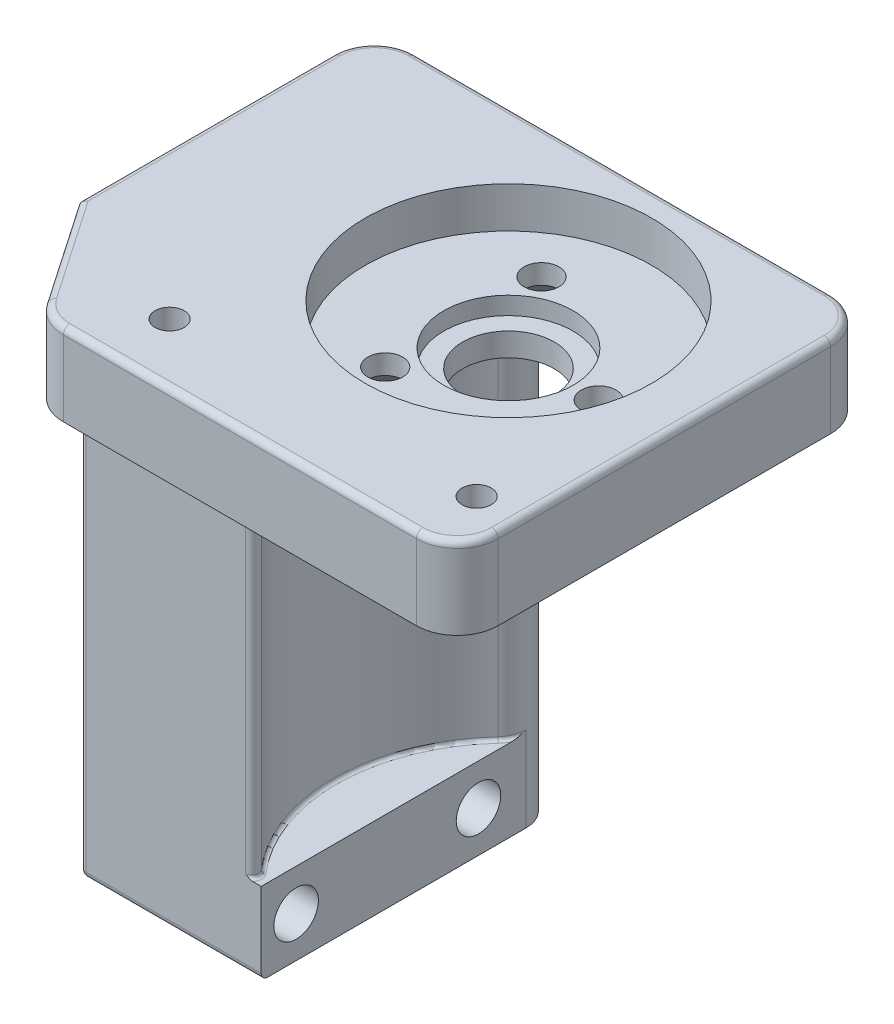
ISO-10303-21;
HEADER;
FILE_DESCRIPTION(('STEP AP214'),'2;1');
FILE_NAME('part.step','',(''),(''),'','','');
FILE_SCHEMA(('AUTOMOTIVE_DESIGN { 1 0 10303 214 1 1 1 1 }'));
ENDSEC;
DATA;
#1=APPLICATION_CONTEXT('core data for automotive mechanical design processes');
#2=APPLICATION_PROTOCOL_DEFINITION('international standard','automotive_design',2000,#1);
#3=PRODUCT_CONTEXT('',#1,'mechanical');
#4=PRODUCT('Part','Part','',(#3));
#5=PRODUCT_RELATED_PRODUCT_CATEGORY('part','',(#4));
#6=PRODUCT_DEFINITION_FORMATION('','',#4);
#7=PRODUCT_DEFINITION_CONTEXT('part definition',#1,'design');
#8=PRODUCT_DEFINITION('design','',#6,#7);
#9=PRODUCT_DEFINITION_SHAPE('','',#8);
#10=(LENGTH_UNIT() NAMED_UNIT(*) SI_UNIT(.MILLI.,.METRE.));
#11=(NAMED_UNIT(*) PLANE_ANGLE_UNIT() SI_UNIT($,.RADIAN.));
#12=(NAMED_UNIT(*) SI_UNIT($,.STERADIAN.) SOLID_ANGLE_UNIT());
#13=UNCERTAINTY_MEASURE_WITH_UNIT(LENGTH_MEASURE(1.E-05),#10,'distance_accuracy_value','');
#14=(GEOMETRIC_REPRESENTATION_CONTEXT(3) GLOBAL_UNCERTAINTY_ASSIGNED_CONTEXT((#13)) GLOBAL_UNIT_ASSIGNED_CONTEXT((#10,
#11,#12)) REPRESENTATION_CONTEXT('',''));
#15=CARTESIAN_POINT('',(0.,0.,0.));
#16=DIRECTION('',(0.,0.,1.));
#17=DIRECTION('',(1.,0.,0.));
#18=AXIS2_PLACEMENT_3D('',#15,#16,#17);
#19=CARTESIAN_POINT('',(-9.39800000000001,-42.32275,-13.081));
#20=DIRECTION('',(1.,0.,0.));
#21=DIRECTION('',(0.,1.,0.));
#22=AXIS2_PLACEMENT_3D('',#19,#20,#21);
#23=PLANE('',#22);
#24=CARTESIAN_POINT('',(-9.39800000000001,-39.14775,-7.0739));
#25=DIRECTION('',(1.,0.,0.));
#26=DIRECTION('',(0.,1.,0.));
#27=AXIS2_PLACEMENT_3D('',#24,#25,#26);
#28=CIRCLE('',#27,1.72719999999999);
#29=CARTESIAN_POINT('',(-9.398,-37.42055,-7.0739));
#30=VERTEX_POINT('',#29);
#31=EDGE_CURVE('E1412',#30,#30,#28,.T.);
#32=ORIENTED_EDGE('',*,*,#31,.F.);
#33=EDGE_LOOP('',(#32));
#34=FACE_BOUND('',#33,.T.);
#35=CARTESIAN_POINT('',(-9.39800000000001,-39.14775,7.0739));
#36=DIRECTION('',(1.,0.,0.));
#37=DIRECTION('',(0.,1.,0.));
#38=AXIS2_PLACEMENT_3D('',#35,#36,#37);
#39=CIRCLE('',#38,1.72719999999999);
#40=CARTESIAN_POINT('',(-9.398,-37.42055,7.0739));
#41=VERTEX_POINT('',#40);
#42=EDGE_CURVE('E53',#41,#41,#39,.T.);
#43=ORIENTED_EDGE('',*,*,#42,.F.);
#44=EDGE_LOOP('',(#43));
#45=FACE_BOUND('',#44,.T.);
#46=DIRECTION('',(0.,1.,0.));
#47=VECTOR('',#46,1.);
#48=CARTESIAN_POINT('',(-9.39800000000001,-42.32275,9.779));
#49=LINE('',#48,#47);
#50=CARTESIAN_POINT('',(-9.39800000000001,-41.81475,9.779));
#51=VERTEX_POINT('',#50);
#52=CARTESIAN_POINT('',(-9.398,-35.97275,9.779));
#53=VERTEX_POINT('',#52);
#54=EDGE_CURVE('E344',#51,#53,#49,.T.);
#55=ORIENTED_EDGE('',*,*,#54,.F.);
#56=CARTESIAN_POINT('',(-9.39800000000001,-41.81475,9.271));
#57=DIRECTION('',(1.,0.,0.));
#58=DIRECTION('',(0.,1.,0.));
#59=AXIS2_PLACEMENT_3D('',#56,#57,#58);
#60=CIRCLE('',#59,0.508);
#61=CARTESIAN_POINT('',(-9.39800000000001,-42.32275,9.271));
#62=VERTEX_POINT('',#61);
#63=EDGE_CURVE('E334',#51,#62,#60,.T.);
#64=ORIENTED_EDGE('',*,*,#63,.T.);
#65=DIRECTION('',(0.,0.,1.));
#66=VECTOR('',#65,1.);
#67=CARTESIAN_POINT('',(-9.39800000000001,-42.32275,-13.081));
#68=LINE('',#67,#66);
#69=CARTESIAN_POINT('',(-9.39800000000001,-42.32275,-10.7605196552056));
#70=VERTEX_POINT('',#69);
#71=EDGE_CURVE('E325',#70,#62,#68,.T.);
#72=ORIENTED_EDGE('',*,*,#71,.F.);
#73=DIRECTION('',(0.,-1.,0.));
#74=VECTOR('',#73,1.);
#75=CARTESIAN_POINT('',(-9.39800000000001,-32.6910952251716,-10.7605196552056));
#76=LINE('',#75,#74);
#77=CARTESIAN_POINT('',(-9.39800000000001,-35.71875,-10.7605196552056));
#78=VERTEX_POINT('',#77);
#79=EDGE_CURVE('E306',#78,#70,#76,.T.);
#80=ORIENTED_EDGE('',*,*,#79,.F.);
#81=CARTESIAN_POINT('',(-9.398,-35.97275,-9.64547704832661));
#82=CARTESIAN_POINT('',(-9.398,-35.9727019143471,-9.68855431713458));
#83=CARTESIAN_POINT('',(-9.398,-35.9707005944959,-9.73156690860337));
#84=CARTESIAN_POINT('',(-9.398,-35.9635477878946,-9.8172508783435));
#85=CARTESIAN_POINT('',(-9.398,-35.9584026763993,-9.85992277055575));
#86=CARTESIAN_POINT('',(-9.398,-35.9457533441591,-9.94461405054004));
#87=CARTESIAN_POINT('',(-9.398,-35.9382645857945,-9.98663587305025));
#88=CARTESIAN_POINT('',(-9.398,-35.9214142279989,-10.0703232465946));
#89=CARTESIAN_POINT('',(-9.398,-35.9120515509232,-10.1119885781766));
#90=CARTESIAN_POINT('',(-9.398,-35.8774206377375,-10.2545577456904));
#91=CARTESIAN_POINT('',(-9.39800000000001,-35.8486226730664,-10.3545886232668));
#92=CARTESIAN_POINT('',(-9.398,-35.7871642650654,-10.5535432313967));
#93=CARTESIAN_POINT('',(-9.39799999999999,-35.7544977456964,-10.6524649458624));
#94=CARTESIAN_POINT('',(-9.398,-35.7207674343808,-10.7544218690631));
#95=CARTESIAN_POINT('',(-9.39800000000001,-35.7197587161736,-10.7574707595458));
#96=CARTESIAN_POINT('',(-9.39800000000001,-35.71875,-10.7605196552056));
#97=B_SPLINE_CURVE_WITH_KNOTS('',3,(#81,#82,#83,#84,#85,#86,#87,#88,#89,#90,#91,#92,#93,#94,#95,
#96),.UNSPECIFIED.,.F.,.F.,(4,2,2,2,2,2,2,4),(0.,0.129097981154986,0.257935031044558,
0.385939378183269,0.514017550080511,0.82606161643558,1.13860245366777,1.14823672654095),.UNSPECIFIED.);
#98=CARTESIAN_POINT('',(-9.398,-35.97275,-9.64547704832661));
#99=VERTEX_POINT('',#98);
#100=EDGE_CURVE('E59',#78,#99,#97,.F.);
#101=ORIENTED_EDGE('',*,*,#100,.T.);
#102=DIRECTION('',(0.,0.,1.));
#103=VECTOR('',#102,1.);
#104=CARTESIAN_POINT('',(-9.398,-35.97275,-13.081));
#105=LINE('',#104,#103);
#106=EDGE_CURVE('E336',#99,#53,#105,.T.);
#107=ORIENTED_EDGE('',*,*,#106,.T.);
#108=EDGE_LOOP('',(#55,#64,#72,#80,#101,#107));
#109=FACE_BOUND('',#108,.T.);
#110=ADVANCED_FACE('F48',(#34,#45,#109),#23,.T.);
#111=CARTESIAN_POINT('',(-23.495,-42.32275,-13.081));
#112=DIRECTION('',(0.,-1.,0.));
#113=DIRECTION('',(0.,0.,-1.));
#114=AXIS2_PLACEMENT_3D('',#111,#112,#113);
#115=PLANE('',#114);
#116=CARTESIAN_POINT('',(-20.32,-42.32275,-9.90600000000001));
#117=DIRECTION('',(0.,-1.,0.));
#118=DIRECTION('',(0.,0.,-1.));
#119=AXIS2_PLACEMENT_3D('',#116,#117,#118);
#120=CIRCLE('',#119,2.667);
#121=CARTESIAN_POINT('',(-22.987,-42.32275,-9.90600000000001));
#122=VERTEX_POINT('',#121);
#123=CARTESIAN_POINT('',(-20.32,-42.32275,-12.573));
#124=VERTEX_POINT('',#123);
#125=EDGE_CURVE('E543',#122,#124,#120,.T.);
#126=ORIENTED_EDGE('',*,*,#125,.T.);
#127=DIRECTION('',(1.,0.,0.));
#128=VECTOR('',#127,1.);
#129=CARTESIAN_POINT('',(-11.7184803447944,-42.32275,-12.573));
#130=LINE('',#129,#128);
#131=CARTESIAN_POINT('',(-10.2695000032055,-42.32275,-12.573));
#132=VERTEX_POINT('',#131);
#133=EDGE_CURVE('E328',#124,#132,#130,.T.);
#134=ORIENTED_EDGE('',*,*,#133,.T.);
#135=CARTESIAN_POINT('',(-11.7184803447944,-42.32275,-10.7605196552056));
#136=DIRECTION('',(0.,1.,0.));
#137=DIRECTION('',(0.,0.,-1.));
#138=AXIS2_PLACEMENT_3D('',#135,#136,#137);
#139=CIRCLE('',#138,2.32048034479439);
#140=EDGE_CURVE('E311',#70,#132,#139,.T.);
#141=ORIENTED_EDGE('',*,*,#140,.F.);
#142=ORIENTED_EDGE('',*,*,#71,.T.);
#143=DIRECTION('',(1.,0.,0.));
#144=VECTOR('',#143,1.);
#145=CARTESIAN_POINT('',(-23.495,-42.32275,9.271));
#146=LINE('',#145,#144);
#147=CARTESIAN_POINT('',(-22.987,-42.32275,9.271));
#148=VERTEX_POINT('',#147);
#149=EDGE_CURVE('E540',#62,#148,#146,.F.);
#150=ORIENTED_EDGE('',*,*,#149,.T.);
#151=DIRECTION('',(0.,0.,1.));
#152=VECTOR('',#151,1.);
#153=CARTESIAN_POINT('',(-22.987,-42.32275,-13.081));
#154=LINE('',#153,#152);
#155=EDGE_CURVE('E537',#148,#122,#154,.F.);
#156=ORIENTED_EDGE('',*,*,#155,.T.);
#157=EDGE_LOOP('',(#126,#134,#141,#142,#150,#156));
#158=FACE_BOUND('',#157,.T.);
#159=ADVANCED_FACE('F324',(#158),#115,.T.);
#160=CARTESIAN_POINT('',(0.,0.,-13.081));
#161=DIRECTION('',(0.,0.,1.));
#162=DIRECTION('',(1.,0.,0.));
#163=AXIS2_PLACEMENT_3D('',#160,#161,#162);
#164=PLANE('',#163);
#165=DIRECTION('',(0.,-1.,0.));
#166=VECTOR('',#165,1.);
#167=CARTESIAN_POINT('',(-20.32,3.175,-13.081));
#168=LINE('',#167,#166);
#169=CARTESIAN_POINT('',(-20.32,-41.81475,-13.081));
#170=VERTEX_POINT('',#169);
#171=CARTESIAN_POINT('',(-20.32,2.66700000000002,-13.081));
#172=VERTEX_POINT('',#171);
#173=EDGE_CURVE('E437',#170,#172,#168,.F.);
#174=ORIENTED_EDGE('',*,*,#173,.T.);
#175=DIRECTION('',(-1.,0.,0.));
#176=VECTOR('',#175,1.);
#177=CARTESIAN_POINT('',(0.,2.66700000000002,-13.081));
#178=LINE('',#177,#176);
#179=CARTESIAN_POINT('',(11.90625,2.66700000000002,-13.081));
#180=VERTEX_POINT('',#179);
#181=EDGE_CURVE('E509',#172,#180,#178,.F.);
#182=ORIENTED_EDGE('',*,*,#181,.T.);
#183=DIRECTION('',(0.,-1.,0.));
#184=VECTOR('',#183,1.);
#185=CARTESIAN_POINT('',(11.90625,-3.17499999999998,-13.081));
#186=LINE('',#185,#184);
#187=CARTESIAN_POINT('',(11.90625,-3.17499999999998,-13.081));
#188=VERTEX_POINT('',#187);
#189=EDGE_CURVE('E434',#180,#188,#186,.T.);
#190=ORIENTED_EDGE('',*,*,#189,.T.);
#191=DIRECTION('',(-1.,0.,0.));
#192=VECTOR('',#191,1.);
#193=CARTESIAN_POINT('',(-15.08125,-3.17499999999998,-13.081));
#194=LINE('',#193,#192);
#195=CARTESIAN_POINT('',(-8.97860442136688,-3.17499999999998,-13.081));
#196=VERTEX_POINT('',#195);
#197=EDGE_CURVE('E319',#188,#196,#194,.T.);
#198=ORIENTED_EDGE('',*,*,#197,.T.);
#199=CARTESIAN_POINT('',(-8.97860442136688,-3.17499999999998,-13.081));
#200=CARTESIAN_POINT('',(-9.05033365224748,-3.17500399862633,-13.081));
#201=CARTESIAN_POINT('',(-9.12198251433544,-3.1785369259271,-13.081));
#202=CARTESIAN_POINT('',(-9.26454903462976,-3.19195589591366,-13.081));
#203=CARTESIAN_POINT('',(-9.33546786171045,-3.2018293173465,-13.081));
#204=CARTESIAN_POINT('',(-9.54467961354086,-3.23956528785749,-13.081));
#205=CARTESIAN_POINT('',(-9.68151001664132,-3.27558591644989,-13.081));
#206=CARTESIAN_POINT('',(-10.0435400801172,-3.39585274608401,-13.081));
#207=CARTESIAN_POINT('',(-10.2632074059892,-3.49619903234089,-13.081));
#208=CARTESIAN_POINT('',(-10.6875566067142,-3.72631752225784,-13.081));
#209=CARTESIAN_POINT('',(-10.8921063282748,-3.85631601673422,-13.081));
#210=CARTESIAN_POINT('',(-11.3017194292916,-4.13681295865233,-13.081));
#211=CARTESIAN_POINT('',(-11.5062812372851,-4.28801725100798,-13.081));
#212=CARTESIAN_POINT('',(-11.713316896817,-4.44118009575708,-13.081));
#213=CARTESIAN_POINT('',(-11.7158986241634,-4.44309005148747,-13.081));
#214=CARTESIAN_POINT('',(-11.7184803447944,-4.44499999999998,-13.081));
#215=B_SPLINE_CURVE_WITH_KNOTS('',3,(#199,#200,#201,#202,#203,#204,#205,#206,#207,#208,#209,
#210,#211,#212,#213,#214),.UNSPECIFIED.,.F.,.F.,(4,2,2,2,2,2,2,4),(0.,0.214976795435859,
0.429526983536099,0.852459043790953,1.57284689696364,2.29892810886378,3.06188694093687,
3.0715212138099),.UNSPECIFIED.);
#216=CARTESIAN_POINT('',(-11.7184803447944,-4.44499999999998,-13.081));
#217=VERTEX_POINT('',#216);
#218=EDGE_CURVE('E901',#196,#217,#215,.T.);
#219=ORIENTED_EDGE('',*,*,#218,.T.);
#220=DIRECTION('',(0.,-1.,0.));
#221=VECTOR('',#220,1.);
#222=CARTESIAN_POINT('',(-11.7184803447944,20.9620174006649,-13.081));
#223=LINE('',#222,#221);
#224=CARTESIAN_POINT('',(-11.7184803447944,-41.81475,-13.081));
#225=VERTEX_POINT('',#224);
#226=EDGE_CURVE('E906',#217,#225,#223,.T.);
#227=ORIENTED_EDGE('',*,*,#226,.T.);
#228=DIRECTION('',(1.,0.,0.));
#229=VECTOR('',#228,1.);
#230=CARTESIAN_POINT('',(-20.32,-41.81475,-13.081));
#231=LINE('',#230,#229);
#232=EDGE_CURVE('E506',#225,#170,#231,.F.);
#233=ORIENTED_EDGE('',*,*,#232,.T.);
#234=EDGE_LOOP('',(#174,#182,#190,#198,#219,#227,#233));
#235=FACE_BOUND('',#234,.T.);
#236=ADVANCED_FACE('F633',(#235),#164,.F.);
#237=CARTESIAN_POINT('',(0.,0.,9.779));
#238=DIRECTION('',(0.,0.,1.));
#239=DIRECTION('',(1.,0.,0.));
#240=AXIS2_PLACEMENT_3D('',#237,#238,#239);
#241=PLANE('',#240);
#242=DIRECTION('',(0.,-1.,0.));
#243=VECTOR('',#242,1.);
#244=CARTESIAN_POINT('',(-10.6195088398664,20.9620174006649,9.779));
#245=LINE('',#244,#243);
#246=CARTESIAN_POINT('',(-10.6195088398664,-4.44499999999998,9.779));
#247=VERTEX_POINT('',#246);
#248=CARTESIAN_POINT('',(-10.6195088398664,-35.71875,9.779));
#249=VERTEX_POINT('',#248);
#250=EDGE_CURVE('E939',#247,#249,#245,.T.);
#251=ORIENTED_EDGE('',*,*,#250,.F.);
#252=DIRECTION('',(1.,0.,0.));
#253=VECTOR('',#252,1.);
#254=CARTESIAN_POINT('',(0.,-4.44499999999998,9.779));
#255=LINE('',#254,#253);
#256=CARTESIAN_POINT('',(-22.6251369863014,-4.44499999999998,9.779));
#257=VERTEX_POINT('',#256);
#258=EDGE_CURVE('E623',#247,#257,#255,.F.);
#259=ORIENTED_EDGE('',*,*,#258,.T.);
#260=CARTESIAN_POINT('',(-21.330307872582,-3.86179926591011,9.779));
#261=CARTESIAN_POINT('',(-21.8992766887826,-3.41842916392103,9.779));
#262=CARTESIAN_POINT('',(-22.1906948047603,-3.1913410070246,10.398523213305));
#263=CARTESIAN_POINT('',(-22.4821129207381,-2.96425285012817,11.0180464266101));
#264=CARTESIAN_POINT('',(-22.2116649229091,-3.17499999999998,11.6526692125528));
#265=CARTESIAN_POINT('',(-21.3627788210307,-3.90347636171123,9.779));
#266=CARTESIAN_POINT('',(-21.908756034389,-3.4398789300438,9.779));
#267=CARTESIAN_POINT('',(-22.1917577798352,-3.19992737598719,10.3911289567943));
#268=CARTESIAN_POINT('',(-22.474760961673,-2.95993516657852,11.003289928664));
#269=CARTESIAN_POINT('',(-22.2220337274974,-3.17499999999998,11.6375307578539));
#270=CARTESIAN_POINT('',(-21.3978191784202,-3.94307693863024,9.779));
#271=CARTESIAN_POINT('',(-21.920222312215,-3.46207269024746,9.779));
#272=CARTESIAN_POINT('',(-22.1942593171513,-3.21011028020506,10.3832859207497));
#273=CARTESIAN_POINT('',(-22.468280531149,-2.95809780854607,10.9876072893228));
#274=CARTESIAN_POINT('',(-22.2332230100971,-3.17499999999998,11.6211944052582));
#275=CARTESIAN_POINT('',(-21.472193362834,-4.01786712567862,9.779));
#276=CARTESIAN_POINT('',(-21.9471777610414,-3.50702062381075,9.779));
#277=CARTESIAN_POINT('',(-22.2024562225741,-3.23283667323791,10.3669519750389));
#278=CARTESIAN_POINT('',(-22.4577160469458,-2.95860729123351,10.9549371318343));
#279=CARTESIAN_POINT('',(-22.2569725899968,-3.17499999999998,11.5865200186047));
#280=CARTESIAN_POINT('',(-21.5115182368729,-4.05306561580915,9.779));
#281=CARTESIAN_POINT('',(-21.9626374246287,-3.52976380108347,9.779));
#282=CARTESIAN_POINT('',(-22.2081450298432,-3.24537527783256,10.3584624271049));
#283=CARTESIAN_POINT('',(-22.4536188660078,-2.96092804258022,10.9379631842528));
#284=CARTESIAN_POINT('',(-22.2695300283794,-3.17499999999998,11.5681861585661));
#285=CARTESIAN_POINT('',(-21.5955614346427,-4.12041320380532,9.779));
#286=CARTESIAN_POINT('',(-21.9984254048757,-3.57605466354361,9.779));
#287=CARTESIAN_POINT('',(-22.2233618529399,-3.27260757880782,10.340670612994));
#288=CARTESIAN_POINT('',(-22.448263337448,-2.96909613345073,10.9023833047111));
#289=CARTESIAN_POINT('',(-22.2963671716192,-3.17499999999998,11.5290039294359));
#290=CARTESIAN_POINT('',(-21.6404407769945,-4.15236049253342,9.779));
#291=CARTESIAN_POINT('',(-22.0189175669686,-3.59959467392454,9.779));
#292=CARTESIAN_POINT('',(-22.2330475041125,-3.28737173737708,10.3313490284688));
#293=CARTESIAN_POINT('',(-22.4471230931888,-2.97507743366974,10.8837427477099));
#294=CARTESIAN_POINT('',(-22.3106982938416,-3.17499999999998,11.5080804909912));
#295=CARTESIAN_POINT('',(-21.7333509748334,-4.21129764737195,9.779));
#296=CARTESIAN_POINT('',(-22.0641169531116,-3.64564417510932,9.779));
#297=CARTESIAN_POINT('',(-22.2562155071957,-3.31771402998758,10.3124339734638));
#298=CARTESIAN_POINT('',(-22.4482586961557,-2.98971156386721,10.8459128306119));
#299=CARTESIAN_POINT('',(-22.3403668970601,-3.17499999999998,11.4647643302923));
#300=CARTESIAN_POINT('',(-21.781383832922,-4.23828432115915,9.779));
#301=CARTESIAN_POINT('',(-22.0888048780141,-3.66815571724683,9.779));
#302=CARTESIAN_POINT('',(-22.2697002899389,-3.33329267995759,10.3028403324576));
#303=CARTESIAN_POINT('',(-22.4505205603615,-2.99835281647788,10.8267274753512));
#304=CARTESIAN_POINT('',(-22.355705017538,-3.17499999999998,11.4423706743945));
#305=CARTESIAN_POINT('',(-21.9299654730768,-4.31214198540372,9.779));
#306=CARTESIAN_POINT('',(-22.1688870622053,-3.73323146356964,9.779));
#307=CARTESIAN_POINT('',(-22.3158372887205,-3.38026755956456,10.2737440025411));
#308=CARTESIAN_POINT('',(-22.4624970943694,-3.02700860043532,10.7686723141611));
#309=CARTESIAN_POINT('',(-22.4031509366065,-3.17499999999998,11.3730996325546));
#310=CARTESIAN_POINT('',(-22.0343797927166,-4.35142931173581,9.779));
#311=CARTESIAN_POINT('',(-22.2303073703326,-3.77334721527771,9.779));
#312=CARTESIAN_POINT('',(-22.3540605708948,-3.41168546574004,10.2540573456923));
#313=CARTESIAN_POINT('',(-22.4774013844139,-3.04975755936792,10.7292956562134));
#314=CARTESIAN_POINT('',(-22.4364931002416,-3.17499999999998,11.3244200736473));
#315=CARTESIAN_POINT('',(-22.2455082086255,-4.4090995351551,9.779));
#316=CARTESIAN_POINT('',(-22.3629063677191,-3.84117159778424,9.779));
#317=CARTESIAN_POINT('',(-22.4410120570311,-3.46869776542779,10.2156795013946));
#318=CARTESIAN_POINT('',(-22.5187293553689,-3.09596519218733,10.6525314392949));
#319=CARTESIAN_POINT('',(-22.503911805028,-3.17499999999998,11.2259887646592));
#320=CARTESIAN_POINT('',(-22.3520768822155,-4.42803504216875,9.779));
#321=CARTESIAN_POINT('',(-22.4336697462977,-3.86929645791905,9.779));
#322=CARTESIAN_POINT('',(-22.4894174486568,-3.4944301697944,10.1969758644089));
#323=CARTESIAN_POINT('',(-22.5447172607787,-3.11937636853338,10.6151083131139));
#324=CARTESIAN_POINT('',(-22.5379419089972,-3.17499999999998,11.1763048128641));
#325=CARTESIAN_POINT('',(-22.5612567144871,-4.4467117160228,9.779));
#326=CARTESIAN_POINT('',(-22.5784332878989,-3.91133609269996,9.779));
#327=CARTESIAN_POINT('',(-22.5913471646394,-3.53714634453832,10.1613975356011));
#328=CARTESIAN_POINT('',(-22.6038608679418,-3.16278871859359,10.5439345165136));
#329=CARTESIAN_POINT('',(-22.6047383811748,-3.17499999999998,11.0787819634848));
#330=CARTESIAN_POINT('',(-22.6637840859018,-4.44740319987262,9.779));
#331=CARTESIAN_POINT('',(-22.6520220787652,-3.92601388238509,9.779));
#332=CARTESIAN_POINT('',(-22.6444724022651,-3.55451666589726,10.1444783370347));
#333=CARTESIAN_POINT('',(-22.6365080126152,-3.18292169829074,10.5100794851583));
#334=CARTESIAN_POINT('',(-22.6374779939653,-3.17499999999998,11.0309821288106));
#335=CARTESIAN_POINT('',(-22.8711684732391,-4.43171635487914,9.779));
#336=CARTESIAN_POINT('',(-22.8049300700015,-3.94258493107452,9.779));
#337=CARTESIAN_POINT('',(-22.7569064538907,-3.58121396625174,10.1111436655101));
#338=CARTESIAN_POINT('',(-22.708442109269,-3.21973760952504,10.4434181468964));
#339=CARTESIAN_POINT('',(-22.7037011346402,-3.17499999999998,10.9342963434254));
#340=CARTESIAN_POINT('',(-22.9759810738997,-4.41473847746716,9.779));
#341=CARTESIAN_POINT('',(-22.8844021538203,-3.94412470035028,9.779));
#342=CARTESIAN_POINT('',(-22.8163667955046,-3.59023746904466,10.0947666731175));
#343=CARTESIAN_POINT('',(-22.7479098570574,-3.23632402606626,10.4106431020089));
#344=CARTESIAN_POINT('',(-22.737170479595,-3.17499999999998,10.8854310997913));
#345=CARTESIAN_POINT('',(-23.1849066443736,-4.36161350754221,9.779));
#346=CARTESIAN_POINT('',(-23.0459153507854,-3.93194793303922,9.779));
#347=CARTESIAN_POINT('',(-22.9388282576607,-3.59801856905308,10.062880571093));
#348=CARTESIAN_POINT('',(-22.8312909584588,-3.26406000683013,10.3468783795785));
#349=CARTESIAN_POINT('',(-22.8038857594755,-3.17499999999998,10.7880267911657));
#350=CARTESIAN_POINT('',(-23.2888460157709,-4.32477150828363,9.779));
#351=CARTESIAN_POINT('',(-23.1280283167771,-3.91776507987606,9.779));
#352=CARTESIAN_POINT('',(-23.0018785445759,-3.59637854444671,10.0474270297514));
#353=CARTESIAN_POINT('',(-22.8753368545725,-3.27504204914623,10.3159459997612));
#354=CARTESIAN_POINT('',(-22.8370762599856,-3.17499999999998,10.739568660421));
#355=CARTESIAN_POINT('',(-23.4875893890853,-4.23117373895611,9.779));
#356=CARTESIAN_POINT('',(-23.2872275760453,-3.87242494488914,9.779));
#357=CARTESIAN_POINT('',(-23.125326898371,-3.58091874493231,10.018473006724));
#358=CARTESIAN_POINT('',(-22.9630363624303,-3.28946041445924,10.2580374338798));
#359=CARTESIAN_POINT('',(-22.9005401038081,-3.17499999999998,10.6469114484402));
#360=CARTESIAN_POINT('',(-23.58238805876,-4.17440643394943,9.779));
#361=CARTESIAN_POINT('',(-23.3644159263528,-3.84134390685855,9.779));
#362=CARTESIAN_POINT('',(-23.1857234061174,-3.56709190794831,10.0049736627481));
#363=CARTESIAN_POINT('',(-23.0067325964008,-3.29294654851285,10.2310119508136));
#364=CARTESIAN_POINT('',(-22.930811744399,-3.17499999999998,10.6027148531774));
#365=CARTESIAN_POINT('',(-23.7542947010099,-4.0433637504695,9.779));
#366=CARTESIAN_POINT('',(-23.5056712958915,-3.76345329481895,9.779));
#367=CARTESIAN_POINT('',(-23.297035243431,-3.5276164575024,9.98088305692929));
#368=CARTESIAN_POINT('',(-23.0881208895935,-3.29187749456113,10.1828262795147));
#369=CARTESIAN_POINT('',(-22.9857059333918,-3.17499999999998,10.5225693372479));
#370=CARTESIAN_POINT('',(-23.8318849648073,-3.96973118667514,9.779));
#371=CARTESIAN_POINT('',(-23.5702018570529,-3.71724760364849,9.779));
#372=CARTESIAN_POINT('',(-23.3481985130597,-3.50237495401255,9.97021022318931));
#373=CARTESIAN_POINT('',(-23.1260217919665,-3.28762348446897,10.1614559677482));
#374=CARTESIAN_POINT('',(-23.01048248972,-3.17499999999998,10.4863955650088));
#375=CARTESIAN_POINT('',(-23.9629119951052,-3.81014602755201,9.779));
#376=CARTESIAN_POINT('',(-23.6797302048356,-3.61317531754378,9.779));
#377=CARTESIAN_POINT('',(-23.4354635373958,-3.44274254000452,9.95238275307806));
#378=CARTESIAN_POINT('',(-23.1910401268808,-3.27241433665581,10.1257974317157));
#379=CARTESIAN_POINT('',(-23.0523227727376,-3.17499999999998,10.4253087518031));
#380=CARTESIAN_POINT('',(-24.0174931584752,-3.72516191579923,9.779));
#381=CARTESIAN_POINT('',(-23.7257525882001,-3.556147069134,9.779));
#382=CARTESIAN_POINT('',(-23.4722694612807,-3.40897080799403,9.94505928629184));
#383=CARTESIAN_POINT('',(-23.218717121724,-3.26188131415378,10.1111322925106));
#384=CARTESIAN_POINT('',(-23.0697519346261,-3.17499999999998,10.3998621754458));
#385=CARTESIAN_POINT('',(-24.0798947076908,-3.5926506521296,9.779));
#386=CARTESIAN_POINT('',(-23.7784979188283,-3.46560144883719,9.779));
#387=CARTESIAN_POINT('',(-23.514558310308,-3.35427174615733,9.93673513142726));
#388=CARTESIAN_POINT('',(-23.2506039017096,-3.24296246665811,10.0944731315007));
#389=CARTESIAN_POINT('',(-23.0896783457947,-3.17499999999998,10.3707696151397));
#390=CARTESIAN_POINT('',(-24.0971104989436,-3.54940454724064,9.779));
#391=CARTESIAN_POINT('',(-23.7930744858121,-3.43584299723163,9.779));
#392=CARTESIAN_POINT('',(-23.5262648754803,-3.33613720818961,9.93444780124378));
#393=CARTESIAN_POINT('',(-23.2594474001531,-3.23644672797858,10.0898971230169));
#394=CARTESIAN_POINT('',(-23.0951757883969,-3.17499999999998,10.3627433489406));
#395=CARTESIAN_POINT('',(-24.1259362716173,-3.4610671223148,9.779));
#396=CARTESIAN_POINT('',(-23.8175000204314,-3.37474404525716,9.779));
#397=CARTESIAN_POINT('',(-23.5459006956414,-3.29868433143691,9.93062599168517));
#398=CARTESIAN_POINT('',(-23.2742935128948,-3.22263929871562,10.082253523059));
#399=CARTESIAN_POINT('',(-23.1043805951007,-3.17499999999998,10.349304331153));
#400=CARTESIAN_POINT('',(-24.1375483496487,-3.41597649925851,9.779));
#401=CARTESIAN_POINT('',(-23.827358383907,-3.34339578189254,9.77899999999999));
#402=CARTESIAN_POINT('',(-23.5538313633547,-3.2793664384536,9.92909123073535));
#403=CARTESIAN_POINT('',(-23.2803017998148,-3.21534634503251,10.0791829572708));
#404=CARTESIAN_POINT('',(-23.1080886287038,-3.17499999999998,10.3438906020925));
#405=CARTESIAN_POINT('',(-24.1541180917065,-3.32814002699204,9.779));
#406=CARTESIAN_POINT('',(-23.8414274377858,-3.28215375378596,9.77899999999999));
#407=CARTESIAN_POINT('',(-23.5651566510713,-3.24150003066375,9.92690326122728));
#408=CARTESIAN_POINT('',(-23.2888832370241,-3.20085440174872,10.0748070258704));
#409=CARTESIAN_POINT('',(-23.1133797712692,-3.17499999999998,10.336165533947));
#410=CARTESIAN_POINT('',(-24.1595143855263,-3.28547638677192,9.779));
#411=CARTESIAN_POINT('',(-23.846014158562,-3.25232319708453,9.77899999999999));
#412=CARTESIAN_POINT('',(-23.5688501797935,-3.22300460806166,9.92619192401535));
#413=CARTESIAN_POINT('',(-23.2916850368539,-3.19368876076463,10.0733840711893));
#414=CARTESIAN_POINT('',(-23.1151029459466,-3.17499999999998,10.333649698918));
#415=CARTESIAN_POINT('',(-24.1650687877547,-3.19976219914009,9.779));
#416=CARTESIAN_POINT('',(-23.8507370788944,-3.19234513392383,9.779));
#417=CARTESIAN_POINT('',(-23.5726541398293,-3.1857752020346,9.92546026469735));
#418=CARTESIAN_POINT('',(-23.2945717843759,-3.17920821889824,10.0719204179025));
#419=CARTESIAN_POINT('',(-23.116876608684,-3.17499999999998,10.3310601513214));
#420=CARTESIAN_POINT('',(-24.1652209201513,-3.15671126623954,9.779));
#421=CARTESIAN_POINT('',(-23.850869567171,-3.16218865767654,9.779));
#422=CARTESIAN_POINT('',(-23.572760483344,-3.16704097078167,9.92544073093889));
#423=CARTESIAN_POINT('',(-23.2946544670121,-3.17189108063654,10.0718808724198));
#424=CARTESIAN_POINT('',(-23.1169251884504,-3.17499999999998,10.3309892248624));
#425=CARTESIAN_POINT('',(-24.1626868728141,-3.11380296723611,9.779));
#426=CARTESIAN_POINT('',(-23.8487117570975,-3.13216230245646,9.779));
#427=CARTESIAN_POINT('',(-23.5710227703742,-3.14839984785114,9.92577400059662));
#428=CARTESIAN_POINT('',(-23.293333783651,-3.16463739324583,10.0725480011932));
#429=CARTESIAN_POINT('',(-23.1161160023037,-3.17499999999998,10.3321706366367));
#430=(BOUNDED_SURFACE() B_SPLINE_SURFACE(3,2,((#260,#261,#262,#263,#264),(#265,#266,#267,#268,
#269),(#270,#271,#272,#273,#274),(#275,#276,#277,#278,#279),(#280,#281,#282,#283,#284),(#285,
#286,#287,#288,#289),(#290,#291,#292,#293,#294),(#295,#296,#297,#298,#299),(#300,#301,#302,#303,
#304),(#305,#306,#307,#308,#309),(#310,#311,#312,#313,#314),(#315,#316,#317,#318,#319),(#320,
#321,#322,#323,#324),(#325,#326,#327,#328,#329),(#330,#331,#332,#333,#334),(#335,#336,#337,#338,
#339),(#340,#341,#342,#343,#344),(#345,#346,#347,#348,#349),(#350,#351,#352,#353,#354),(#355,
#356,#357,#358,#359),(#360,#361,#362,#363,#364),(#365,#366,#367,#368,#369),(#370,#371,#372,#373,
#374),(#375,#376,#377,#378,#379),(#380,#381,#382,#383,#384),(#385,#386,#387,#388,#389),(#390,
#391,#392,#393,#394),(#395,#396,#397,#398,#399),(#400,#401,#402,#403,#404),(#405,#406,#407,#408,
#409),(#410,#411,#412,#413,#414),(#415,#416,#417,#418,#419),(#420,#421,#422,#423,#424),(#425,
#426,#427,#428,#429)),.UNSPECIFIED.,.F.,.F.,.F.) B_SPLINE_SURFACE_WITH_KNOTS((4,2,2,2,2,2,2,2,2,
2,2,2,2,2,2,2,4),(3,2,3),(0.,0.158310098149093,0.316295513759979,0.481219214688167,
0.646248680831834,0.978612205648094,1.3017035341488,1.60793008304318,1.92489706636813,
2.25374918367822,2.58279199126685,2.900926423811,3.20051427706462,3.33984535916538,
3.479124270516,3.60781896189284,3.73666030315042),(0.,0.5,1.),
.UNSPECIFIED.) GEOMETRIC_REPRESENTATION_ITEM() RATIONAL_B_SPLINE_SURFACE(((1.,0.869536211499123,
1.,0.869536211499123,1.),(1.,0.871210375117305,1.,0.871210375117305,1.),(1.,0.872980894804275,
1.,0.872980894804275,1.),(1.,0.876656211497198,1.,0.876656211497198,1.),(1.,0.878560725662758,
1.,0.878560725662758,1.),(1.,0.882538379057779,1.,0.882538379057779,1.),(1.,0.884615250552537,
1.,0.884615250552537,1.),(1.,0.888814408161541,1.,0.888814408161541,1.),(1.,0.890936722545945,
1.,0.890936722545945,1.),(1.,0.89735005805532,1.,0.89735005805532,1.),(1.,0.901658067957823,1.,
0.901658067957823,1.),(1.,0.909997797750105,1.,0.909997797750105,1.),(1.,0.914033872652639,1.,
0.914033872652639,1.),(1.,0.921663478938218,1.,0.921663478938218,1.),(1.,0.925269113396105,1.,
0.925269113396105,1.),(1.,0.932334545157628,1.,0.932334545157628,1.),(1.,0.935784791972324,1.,
0.935784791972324,1.),(1.,0.942468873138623,1.,0.942468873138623,1.),(1.,0.94568974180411,1.,
0.94568974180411,1.),(1.,0.951697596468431,1.,0.951697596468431,1.),(1.,0.954484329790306,1.,
0.954484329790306,1.),(1.,0.959439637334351,1.,0.959439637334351,1.),(1.,0.961625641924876,1.,
0.961625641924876,1.),(1.,0.965267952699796,1.,0.965267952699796,1.),(1.,0.966759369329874,1.,
0.966759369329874,1.),(1.,0.968452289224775,1.,0.968452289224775,1.),(1.,0.968917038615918,1.,
0.968917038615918,1.),(1.,0.969693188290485,1.,0.969693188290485,1.),(1.,0.970004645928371,1.,
0.970004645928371,1.),(1.,0.970448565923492,1.,0.970448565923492,1.),(1.,0.970592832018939,1.,
0.970592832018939,1.),(1.,0.970741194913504,1.,0.970741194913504,1.),(1.,0.970745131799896,1.,
0.970745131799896,1.),(1.,0.970677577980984,1.,0.970677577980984,1.))) REPRESENTATION_ITEM('') SURFACE());
#431=CARTESIAN_POINT('',(-21.330307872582,-3.86179926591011,9.779));
#432=CARTESIAN_POINT('',(-21.3627788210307,-3.90347636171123,9.779));
#433=CARTESIAN_POINT('',(-21.3978191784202,-3.94307693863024,9.779));
#434=CARTESIAN_POINT('',(-21.472193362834,-4.01786712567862,9.779));
#435=CARTESIAN_POINT('',(-21.5115182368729,-4.05306561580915,9.779));
#436=CARTESIAN_POINT('',(-21.5955614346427,-4.12041320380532,9.779));
#437=CARTESIAN_POINT('',(-21.6404407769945,-4.15236049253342,9.779));
#438=CARTESIAN_POINT('',(-21.7333509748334,-4.21129764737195,9.779));
#439=CARTESIAN_POINT('',(-21.781383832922,-4.23828432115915,9.779));
#440=CARTESIAN_POINT('',(-21.9299654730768,-4.31214198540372,9.779));
#441=CARTESIAN_POINT('',(-22.0343797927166,-4.35142931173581,9.779));
#442=CARTESIAN_POINT('',(-22.2455082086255,-4.4090995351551,9.779));
#443=CARTESIAN_POINT('',(-22.3520768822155,-4.42803504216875,9.779));
#444=CARTESIAN_POINT('',(-22.5612567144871,-4.4467117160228,9.779));
#445=CARTESIAN_POINT('',(-22.6637840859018,-4.44740319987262,9.779));
#446=CARTESIAN_POINT('',(-22.8711684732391,-4.43171635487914,9.779));
#447=CARTESIAN_POINT('',(-22.9759810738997,-4.41473847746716,9.779));
#448=CARTESIAN_POINT('',(-23.1849066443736,-4.36161350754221,9.779));
#449=CARTESIAN_POINT('',(-23.2888460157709,-4.32477150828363,9.779));
#450=CARTESIAN_POINT('',(-23.4875893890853,-4.23117373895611,9.779));
#451=CARTESIAN_POINT('',(-23.58238805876,-4.17440643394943,9.779));
#452=CARTESIAN_POINT('',(-23.7542947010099,-4.0433637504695,9.779));
#453=CARTESIAN_POINT('',(-23.8318849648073,-3.96973118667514,9.779));
#454=CARTESIAN_POINT('',(-23.9629119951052,-3.810146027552,9.779));
#455=CARTESIAN_POINT('',(-24.0174931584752,-3.72516191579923,9.779));
#456=CARTESIAN_POINT('',(-24.0798947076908,-3.5926506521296,9.779));
#457=CARTESIAN_POINT('',(-24.0971104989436,-3.54940454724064,9.779));
#458=CARTESIAN_POINT('',(-24.1259362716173,-3.4610671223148,9.779));
#459=CARTESIAN_POINT('',(-24.1375483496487,-3.41597649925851,9.779));
#460=CARTESIAN_POINT('',(-24.1541180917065,-3.32814002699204,9.779));
#461=CARTESIAN_POINT('',(-24.1595143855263,-3.28547638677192,9.779));
#462=CARTESIAN_POINT('',(-24.1650687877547,-3.19976219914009,9.779));
#463=CARTESIAN_POINT('',(-24.1652209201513,-3.15671126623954,9.779));
#464=CARTESIAN_POINT('',(-24.1626868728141,-3.11380296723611,9.779));
#465=B_SPLINE_CURVE_WITH_KNOTS('',3,(#431,#432,#433,#434,#435,#436,#437,#438,#439,#440,#441,
#442,#443,#444,#445,#446,#447,#448,#449,#450,#451,#452,#453,#454,#455,#456,#457,#458,#459,#460,
#461,#462,#463,#464),.UNSPECIFIED.,.F.,.F.,(4,2,2,2,2,2,2,2,2,2,2,2,2,2,2,2,4),(0.,
0.158310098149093,0.316295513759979,0.481219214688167,0.646248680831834,0.978612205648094,
1.3017035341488,1.60793008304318,1.92489706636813,2.25374918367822,2.58279199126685,
2.900926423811,3.20051427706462,3.33984535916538,3.479124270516,3.60781896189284,
3.73666030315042),.UNSPECIFIED.);
#466=CARTESIAN_POINT('',(-22.987,-4.40941046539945,9.779));
#467=VERTEX_POINT('',#466);
#468=EDGE_CURVE('E614',#257,#467,#465,.T.);
#469=ORIENTED_EDGE('',*,*,#468,.T.);
#470=DIRECTION('',(0.,-1.,0.));
#471=VECTOR('',#470,1.);
#472=CARTESIAN_POINT('',(-22.987,0.,9.779));
#473=LINE('',#472,#471);
#474=CARTESIAN_POINT('',(-22.987,-41.81475,9.779));
#475=VERTEX_POINT('',#474);
#476=EDGE_CURVE('E548',#467,#475,#473,.T.);
#477=ORIENTED_EDGE('',*,*,#476,.T.);
#478=DIRECTION('',(1.,0.,0.));
#479=VECTOR('',#478,1.);
#480=CARTESIAN_POINT('',(0.,-41.81475,9.779));
#481=LINE('',#480,#479);
#482=EDGE_CURVE('E551',#475,#51,#481,.T.);
#483=ORIENTED_EDGE('',*,*,#482,.T.);
#484=ORIENTED_EDGE('',*,*,#54,.T.);
#485=DIRECTION('',(-1.,0.,0.));
#486=VECTOR('',#485,1.);
#487=CARTESIAN_POINT('',(-9.398,-35.97275,9.779));
#488=LINE('',#487,#486);
#489=CARTESIAN_POINT('',(-10.0515475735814,-35.97275,9.779));
#490=VERTEX_POINT('',#489);
#491=EDGE_CURVE('E337',#53,#490,#488,.T.);
#492=ORIENTED_EDGE('',*,*,#491,.T.);
#493=CARTESIAN_POINT('',(-10.0515475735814,-35.97275,9.779));
#494=CARTESIAN_POINT('',(-10.0817729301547,-35.972729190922,9.779));
#495=CARTESIAN_POINT('',(-10.1117973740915,-35.9697681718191,9.779));
#496=CARTESIAN_POINT('',(-10.1705310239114,-35.9592195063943,9.779));
#497=CARTESIAN_POINT('',(-10.1992538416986,-35.9517102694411,9.779));
#498=CARTESIAN_POINT('',(-10.2889592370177,-35.922258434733,9.779));
#499=CARTESIAN_POINT('',(-10.3476899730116,-35.8937707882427,9.779));
#500=CARTESIAN_POINT('',(-10.460729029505,-35.8287348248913,9.779));
#501=CARTESIAN_POINT('',(-10.5149837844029,-35.7921041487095,9.779));
#502=CARTESIAN_POINT('',(-10.5843880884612,-35.7435729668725,9.779));
#503=CARTESIAN_POINT('',(-10.600110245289,-35.7324660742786,9.779));
#504=CARTESIAN_POINT('',(-10.6170551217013,-35.720485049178,9.779));
#505=CARTESIAN_POINT('',(-10.6182819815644,-35.7196175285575,9.779));
#506=CARTESIAN_POINT('',(-10.6195088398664,-35.71875,9.779));
#507=B_SPLINE_CURVE_WITH_KNOTS('',3,(#493,#494,#495,#496,#497,#498,#499,#500,#501,#502,#503,
#504,#505,#506),.UNSPECIFIED.,.F.,.F.,(4,2,2,2,2,2,4),(0.,0.0902474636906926,0.178981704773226,
0.373227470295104,0.569535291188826,0.627285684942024,0.631793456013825),.UNSPECIFIED.);
#508=EDGE_CURVE('E11',#490,#249,#507,.T.);
#509=ORIENTED_EDGE('',*,*,#508,.T.);
#510=EDGE_LOOP('',(#251,#259,#469,#477,#483,#484,#492,#509));
#511=FACE_BOUND('',#510,.T.);
#512=ADVANCED_FACE('F627',(#511),#241,.T.);
#513=CARTESIAN_POINT('',(15.08125,-3.17499999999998,19.05));
#514=DIRECTION('',(0.,1.,0.));
#515=DIRECTION('',(0.,0.,1.));
#516=AXIS2_PLACEMENT_3D('',#513,#514,#515);
#517=PLANE('',#516);
#518=CARTESIAN_POINT('',(0.,-3.17499999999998,0.));
#519=DIRECTION('',(0.,1.,0.));
#520=DIRECTION('',(0.,0.,1.));
#521=AXIS2_PLACEMENT_3D('',#518,#519,#520);
#522=CIRCLE('',#521,12.319);
#523=CARTESIAN_POINT('',(-9.28011132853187,-3.17499999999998,8.10168468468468));
#524=VERTEX_POINT('',#523);
#525=CARTESIAN_POINT('',(-9.07383247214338,-3.17499999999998,-8.33206608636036));
#526=VERTEX_POINT('',#525);
#527=EDGE_CURVE('E882',#524,#526,#522,.F.);
#528=ORIENTED_EDGE('',*,*,#527,.T.);
#529=CARTESIAN_POINT('',(-11.7184803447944,-3.17499999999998,-10.7605196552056));
#530=DIRECTION('',(0.,1.,0.));
#531=DIRECTION('',(0.,0.,1.));
#532=AXIS2_PLACEMENT_3D('',#529,#530,#531);
#533=CIRCLE('',#532,3.59048034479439);
#534=EDGE_CURVE('E615',#526,#196,#533,.T.);
#535=ORIENTED_EDGE('',*,*,#534,.T.);
#536=ORIENTED_EDGE('',*,*,#197,.F.);
#537=CARTESIAN_POINT('',(11.90625,-3.17499999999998,-9.90600000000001));
#538=DIRECTION('',(0.,1.,0.));
#539=DIRECTION('',(0.,0.,1.));
#540=AXIS2_PLACEMENT_3D('',#537,#538,#539);
#541=CIRCLE('',#540,3.175);
#542=CARTESIAN_POINT('',(15.08125,-3.17499999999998,-9.90600000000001));
#543=VERTEX_POINT('',#542);
#544=EDGE_CURVE('E447',#188,#543,#541,.F.);
#545=ORIENTED_EDGE('',*,*,#544,.T.);
#546=DIRECTION('',(0.,0.,-1.));
#547=VECTOR('',#546,1.);
#548=CARTESIAN_POINT('',(15.08125,-3.17499999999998,19.05));
#549=LINE('',#548,#547);
#550=CARTESIAN_POINT('',(15.08125,-3.17499999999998,15.875));
#551=VERTEX_POINT('',#550);
#552=EDGE_CURVE('E410',#551,#543,#549,.T.);
#553=ORIENTED_EDGE('',*,*,#552,.F.);
#554=CARTESIAN_POINT('',(11.90625,-3.17499999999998,15.875));
#555=DIRECTION('',(0.,1.,0.));
#556=DIRECTION('',(0.,0.,1.));
#557=AXIS2_PLACEMENT_3D('',#554,#555,#556);
#558=CIRCLE('',#557,3.175);
#559=CARTESIAN_POINT('',(11.90625,-3.17499999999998,19.05));
#560=VERTEX_POINT('',#559);
#561=EDGE_CURVE('E444',#551,#560,#558,.F.);
#562=ORIENTED_EDGE('',*,*,#561,.T.);
#563=DIRECTION('',(-1.,0.,0.));
#564=VECTOR('',#563,1.);
#565=CARTESIAN_POINT('',(15.08125,-3.17499999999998,19.05));
#566=LINE('',#565,#564);
#567=CARTESIAN_POINT('',(-15.4713123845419,-3.17499999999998,19.05));
#568=VERTEX_POINT('',#567);
#569=EDGE_CURVE('E417',#560,#568,#566,.T.);
#570=ORIENTED_EDGE('',*,*,#569,.T.);
#571=CARTESIAN_POINT('',(-15.4713123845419,-3.17499999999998,15.875));
#572=DIRECTION('',(0.,1.,0.));
#573=DIRECTION('',(0.,0.,1.));
#574=AXIS2_PLACEMENT_3D('',#571,#572,#573);
#575=CIRCLE('',#574,3.175);
#576=CARTESIAN_POINT('',(-18.0907824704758,-3.17499999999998,17.6691575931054));
#577=VERTEX_POINT('',#576);
#578=EDGE_CURVE('E441',#568,#577,#575,.F.);
#579=ORIENTED_EDGE('',*,*,#578,.T.);
#580=DIRECTION('',(-0.565089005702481,0.,-0.825029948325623));
#581=VECTOR('',#580,1.);
#582=CARTESIAN_POINT('',(-17.145,-3.17499999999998,19.05));
#583=LINE('',#582,#581);
#584=CARTESIAN_POINT('',(-22.6251369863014,-3.17499999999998,11.049));
#585=VERTEX_POINT('',#584);
#586=EDGE_CURVE('E949',#577,#585,#583,.T.);
#587=ORIENTED_EDGE('',*,*,#586,.T.);
#588=DIRECTION('',(1.,0.,0.));
#589=VECTOR('',#588,1.);
#590=CARTESIAN_POINT('',(15.08125,-3.17499999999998,11.049));
#591=LINE('',#590,#589);
#592=CARTESIAN_POINT('',(-10.6195088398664,-3.17499999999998,11.049));
#593=VERTEX_POINT('',#592);
#594=EDGE_CURVE('E886',#585,#593,#591,.T.);
#595=ORIENTED_EDGE('',*,*,#594,.T.);
#596=CARTESIAN_POINT('',(-10.6195088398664,-3.17499999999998,9.271));
#597=DIRECTION('',(0.,1.,0.));
#598=DIRECTION('',(0.,0.,1.));
#599=AXIS2_PLACEMENT_3D('',#596,#597,#598);
#600=CIRCLE('',#599,1.778);
#601=EDGE_CURVE('E884',#593,#524,#600,.T.);
#602=ORIENTED_EDGE('',*,*,#601,.T.);
#603=EDGE_LOOP('',(#528,#535,#536,#545,#553,#562,#570,#579,#587,#595,#602));
#604=FACE_BOUND('',#603,.T.);
#605=CARTESIAN_POINT('',(11.90625,-3.17499999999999,14.3764));
#606=DIRECTION('',(0.,1.,0.));
#607=DIRECTION('',(0.,0.,1.));
#608=AXIS2_PLACEMENT_3D('',#605,#606,#607);
#609=CIRCLE('',#608,1.13029999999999);
#610=CARTESIAN_POINT('',(11.90625,-3.17499999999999,15.5067));
#611=VERTEX_POINT('',#610);
#612=EDGE_CURVE('E350',#611,#611,#609,.T.);
#613=ORIENTED_EDGE('',*,*,#612,.T.);
#614=EDGE_LOOP('',(#613));
#615=FACE_BOUND('',#614,.T.);
#616=CARTESIAN_POINT('',(-11.90625,-3.17499999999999,14.3764));
#617=DIRECTION('',(0.,1.,0.));
#618=DIRECTION('',(0.,0.,1.));
#619=AXIS2_PLACEMENT_3D('',#616,#617,#618);
#620=CIRCLE('',#619,1.13029999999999);
#621=CARTESIAN_POINT('',(-11.90625,-3.17499999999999,15.5067));
#622=VERTEX_POINT('',#621);
#623=EDGE_CURVE('E358',#622,#622,#620,.T.);
#624=ORIENTED_EDGE('',*,*,#623,.T.);
#625=EDGE_LOOP('',(#624));
#626=FACE_BOUND('',#625,.T.);
#627=CARTESIAN_POINT('',(6.9977,-3.17499999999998,0.));
#628=DIRECTION('',(0.,-1.,0.));
#629=DIRECTION('',(0.,0.,-1.));
#630=AXIS2_PLACEMENT_3D('',#627,#628,#629);
#631=CIRCLE('',#630,3.004);
#632=CARTESIAN_POINT('',(6.9977,-3.17499999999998,-3.004));
#633=VERTEX_POINT('',#632);
#634=EDGE_CURVE('E366',#633,#633,#631,.T.);
#635=ORIENTED_EDGE('',*,*,#634,.F.);
#636=EDGE_LOOP('',(#635));
#637=FACE_BOUND('',#636,.T.);
#638=CARTESIAN_POINT('',(0.,-3.17499999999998,0.));
#639=DIRECTION('',(0.,1.,0.));
#640=DIRECTION('',(0.,0.,1.));
#641=AXIS2_PLACEMENT_3D('',#638,#639,#640);
#642=CIRCLE('',#641,3.556);
#643=CARTESIAN_POINT('',(0.,-3.17499999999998,3.556));
#644=VERTEX_POINT('',#643);
#645=EDGE_CURVE('E393',#644,#644,#642,.F.);
#646=ORIENTED_EDGE('',*,*,#645,.F.);
#647=EDGE_LOOP('',(#646));
#648=FACE_BOUND('',#647,.T.);
#649=CARTESIAN_POINT('',(-3.49884999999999,-3.17499999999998,6.06018596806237));
#650=DIRECTION('',(0.,-1.,0.));
#651=DIRECTION('',(0.,0.,-1.));
#652=AXIS2_PLACEMENT_3D('',#649,#650,#651);
#653=CIRCLE('',#652,3.004);
#654=CARTESIAN_POINT('',(-3.49884999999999,-3.17499999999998,3.05618596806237));
#655=VERTEX_POINT('',#654);
#656=EDGE_CURVE('E384',#655,#655,#653,.T.);
#657=ORIENTED_EDGE('',*,*,#656,.F.);
#658=EDGE_LOOP('',(#657));
#659=FACE_BOUND('',#658,.T.);
#660=CARTESIAN_POINT('',(-3.49885,-3.17499999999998,-6.06018596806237));
#661=DIRECTION('',(0.,-1.,0.));
#662=DIRECTION('',(0.,0.,-1.));
#663=AXIS2_PLACEMENT_3D('',#660,#661,#662);
#664=CIRCLE('',#663,3.004);
#665=CARTESIAN_POINT('',(-3.49885,-3.17499999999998,-9.06418596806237));
#666=VERTEX_POINT('',#665);
#667=EDGE_CURVE('E375',#666,#666,#664,.T.);
#668=ORIENTED_EDGE('',*,*,#667,.F.);
#669=EDGE_LOOP('',(#668));
#670=FACE_BOUND('',#669,.T.);
#671=ADVANCED_FACE('F632',(#604,#615,#626,#637,#648,#659,#670),#517,.F.);
#672=CARTESIAN_POINT('',(15.08125,3.175,19.05));
#673=DIRECTION('',(0.,0.,-1.));
#674=DIRECTION('',(-1.,0.,0.));
#675=AXIS2_PLACEMENT_3D('',#672,#673,#674);
#676=PLANE('',#675);
#677=DIRECTION('',(0.,-1.,0.));
#678=VECTOR('',#677,1.);
#679=CARTESIAN_POINT('',(11.90625,3.175,19.05));
#680=LINE('',#679,#678);
#681=CARTESIAN_POINT('',(11.90625,2.667,19.05));
#682=VERTEX_POINT('',#681);
#683=EDGE_CURVE('E460',#560,#682,#680,.F.);
#684=ORIENTED_EDGE('',*,*,#683,.T.);
#685=DIRECTION('',(-1.,0.,0.));
#686=VECTOR('',#685,1.);
#687=CARTESIAN_POINT('',(15.08125,2.667,19.05));
#688=LINE('',#687,#686);
#689=CARTESIAN_POINT('',(-15.4713123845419,2.667,19.05));
#690=VERTEX_POINT('',#689);
#691=EDGE_CURVE('E534',#682,#690,#688,.T.);
#692=ORIENTED_EDGE('',*,*,#691,.T.);
#693=DIRECTION('',(0.,1.,0.));
#694=VECTOR('',#693,1.);
#695=CARTESIAN_POINT('',(-15.4713123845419,-3.17499999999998,19.05));
#696=LINE('',#695,#694);
#697=EDGE_CURVE('E457',#690,#568,#696,.F.);
#698=ORIENTED_EDGE('',*,*,#697,.T.);
#699=ORIENTED_EDGE('',*,*,#569,.F.);
#700=EDGE_LOOP('',(#684,#692,#698,#699));
#701=FACE_BOUND('',#700,.T.);
#702=ADVANCED_FACE('F792',(#701),#676,.F.);
#703=CARTESIAN_POINT('',(15.08125,3.175,19.05));
#704=DIRECTION('',(0.,-1.,0.));
#705=DIRECTION('',(0.,0.,-1.));
#706=AXIS2_PLACEMENT_3D('',#703,#704,#705);
#707=PLANE('',#706);
#708=DIRECTION('',(-1.,0.,0.));
#709=VECTOR('',#708,1.);
#710=CARTESIAN_POINT('',(15.08125,3.175,18.542));
#711=LINE('',#710,#709);
#712=CARTESIAN_POINT('',(-15.4713123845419,3.175,18.542));
#713=VERTEX_POINT('',#712);
#714=CARTESIAN_POINT('',(11.90625,3.175,18.542));
#715=VERTEX_POINT('',#714);
#716=EDGE_CURVE('E468',#713,#715,#711,.F.);
#717=ORIENTED_EDGE('',*,*,#716,.T.);
#718=CARTESIAN_POINT('',(11.90625,3.175,15.875));
#719=DIRECTION('',(0.,-1.,0.));
#720=DIRECTION('',(0.,0.,-1.));
#721=AXIS2_PLACEMENT_3D('',#718,#719,#720);
#722=CIRCLE('',#721,2.667);
#723=CARTESIAN_POINT('',(14.57325,3.175,15.875));
#724=VERTEX_POINT('',#723);
#725=EDGE_CURVE('E492',#715,#724,#722,.F.);
#726=ORIENTED_EDGE('',*,*,#725,.T.);
#727=DIRECTION('',(0.,0.,1.));
#728=VECTOR('',#727,1.);
#729=CARTESIAN_POINT('',(14.57325,3.17500000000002,-9.90600000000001));
#730=LINE('',#729,#728);
#731=CARTESIAN_POINT('',(14.57325,3.17500000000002,-9.90600000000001));
#732=VERTEX_POINT('',#731);
#733=EDGE_CURVE('E489',#724,#732,#730,.F.);
#734=ORIENTED_EDGE('',*,*,#733,.T.);
#735=CARTESIAN_POINT('',(11.90625,3.17500000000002,-9.90600000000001));
#736=DIRECTION('',(0.,-1.,0.));
#737=DIRECTION('',(0.,0.,-1.));
#738=AXIS2_PLACEMENT_3D('',#735,#736,#737);
#739=CIRCLE('',#738,2.667);
#740=CARTESIAN_POINT('',(11.90625,3.17500000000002,-12.573));
#741=VERTEX_POINT('',#740);
#742=EDGE_CURVE('E486',#732,#741,#739,.F.);
#743=ORIENTED_EDGE('',*,*,#742,.T.);
#744=DIRECTION('',(-1.,0.,0.));
#745=VECTOR('',#744,1.);
#746=CARTESIAN_POINT('',(15.08125,3.17500000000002,-12.573));
#747=LINE('',#746,#745);
#748=CARTESIAN_POINT('',(-20.32,3.17500000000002,-12.573));
#749=VERTEX_POINT('',#748);
#750=EDGE_CURVE('E483',#741,#749,#747,.T.);
#751=ORIENTED_EDGE('',*,*,#750,.T.);
#752=CARTESIAN_POINT('',(-20.32,3.17500000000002,-9.90600000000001));
#753=DIRECTION('',(0.,-1.,0.));
#754=DIRECTION('',(0.,0.,-1.));
#755=AXIS2_PLACEMENT_3D('',#752,#753,#754);
#756=CIRCLE('',#755,2.667);
#757=CARTESIAN_POINT('',(-22.987,3.17500000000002,-9.90600000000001));
#758=VERTEX_POINT('',#757);
#759=EDGE_CURVE('E480',#749,#758,#756,.F.);
#760=ORIENTED_EDGE('',*,*,#759,.T.);
#761=DIRECTION('',(0.,0.,1.));
#762=VECTOR('',#761,1.);
#763=CARTESIAN_POINT('',(-22.987,3.17500000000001,9.779));
#764=LINE('',#763,#762);
#765=CARTESIAN_POINT('',(-22.987,3.17500000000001,9.62170657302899));
#766=VERTEX_POINT('',#765);
#767=EDGE_CURVE('E477',#758,#766,#764,.T.);
#768=ORIENTED_EDGE('',*,*,#767,.T.);
#769=DIRECTION('',(0.565089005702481,0.,0.825029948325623));
#770=VECTOR('',#769,1.);
#771=CARTESIAN_POINT('',(-17.6716672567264,3.175,17.3820923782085));
#772=LINE('',#771,#770);
#773=CARTESIAN_POINT('',(-17.6716672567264,3.175,17.3820923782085));
#774=VERTEX_POINT('',#773);
#775=EDGE_CURVE('E474',#766,#774,#772,.T.);
#776=ORIENTED_EDGE('',*,*,#775,.T.);
#777=CARTESIAN_POINT('',(-15.4713123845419,3.175,15.875));
#778=DIRECTION('',(0.,-1.,0.));
#779=DIRECTION('',(0.,0.,-1.));
#780=AXIS2_PLACEMENT_3D('',#777,#778,#779);
#781=CIRCLE('',#780,2.667);
#782=EDGE_CURVE('E471',#774,#713,#781,.F.);
#783=ORIENTED_EDGE('',*,*,#782,.T.);
#784=EDGE_LOOP('',(#717,#726,#734,#743,#751,#760,#768,#776,#783));
#785=FACE_BOUND('',#784,.T.);
#786=CARTESIAN_POINT('',(11.90625,3.175,14.3764));
#787=DIRECTION('',(0.,1.,0.));
#788=DIRECTION('',(0.,0.,1.));
#789=AXIS2_PLACEMENT_3D('',#786,#787,#788);
#790=CIRCLE('',#789,1.13029999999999);
#791=CARTESIAN_POINT('',(11.90625,3.175,15.5067));
#792=VERTEX_POINT('',#791);
#793=EDGE_CURVE('E341',#792,#792,#790,.T.);
#794=ORIENTED_EDGE('',*,*,#793,.F.);
#795=EDGE_LOOP('',(#794));
#796=FACE_BOUND('',#795,.T.);
#797=CARTESIAN_POINT('',(-11.90625,3.175,14.3764));
#798=DIRECTION('',(0.,1.,0.));
#799=DIRECTION('',(0.,0.,1.));
#800=AXIS2_PLACEMENT_3D('',#797,#798,#799);
#801=CIRCLE('',#800,1.13029999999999);
#802=CARTESIAN_POINT('',(-11.90625,3.175,15.5067));
#803=VERTEX_POINT('',#802);
#804=EDGE_CURVE('E354',#803,#803,#801,.T.);
#805=ORIENTED_EDGE('',*,*,#804,.F.);
#806=EDGE_LOOP('',(#805));
#807=FACE_BOUND('',#806,.T.);
#808=CARTESIAN_POINT('',(0.,3.17500000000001,0.));
#809=DIRECTION('',(0.,1.,0.));
#810=DIRECTION('',(0.,0.,1.));
#811=AXIS2_PLACEMENT_3D('',#808,#809,#810);
#812=CIRCLE('',#811,11.1125);
#813=CARTESIAN_POINT('',(0.,3.175,11.1125));
#814=VERTEX_POINT('',#813);
#815=EDGE_CURVE('E402',#814,#814,#812,.T.);
#816=ORIENTED_EDGE('',*,*,#815,.F.);
#817=EDGE_LOOP('',(#816));
#818=FACE_BOUND('',#817,.T.);
#819=ADVANCED_FACE('F789',(#785,#796,#807,#818),#707,.F.);
#820=CARTESIAN_POINT('',(15.08125,-3.17499999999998,19.05));
#821=DIRECTION('',(1.,0.,0.));
#822=DIRECTION('',(0.,0.,-1.));
#823=AXIS2_PLACEMENT_3D('',#820,#821,#822);
#824=PLANE('',#823);
#825=DIRECTION('',(0.,-1.,0.));
#826=VECTOR('',#825,1.);
#827=CARTESIAN_POINT('',(15.08125,3.17500000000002,-9.90600000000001));
#828=LINE('',#827,#826);
#829=CARTESIAN_POINT('',(15.08125,2.66700000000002,-9.90600000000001));
#830=VERTEX_POINT('',#829);
#831=EDGE_CURVE('E453',#543,#830,#828,.F.);
#832=ORIENTED_EDGE('',*,*,#831,.T.);
#833=DIRECTION('',(0.,0.,1.));
#834=VECTOR('',#833,1.);
#835=CARTESIAN_POINT('',(15.08125,2.667,15.875));
#836=LINE('',#835,#834);
#837=CARTESIAN_POINT('',(15.08125,2.667,15.875));
#838=VERTEX_POINT('',#837);
#839=EDGE_CURVE('E500',#830,#838,#836,.T.);
#840=ORIENTED_EDGE('',*,*,#839,.T.);
#841=DIRECTION('',(0.,-1.,0.));
#842=VECTOR('',#841,1.);
#843=CARTESIAN_POINT('',(15.08125,-3.17499999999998,15.875));
#844=LINE('',#843,#842);
#845=EDGE_CURVE('E450',#838,#551,#844,.T.);
#846=ORIENTED_EDGE('',*,*,#845,.T.);
#847=ORIENTED_EDGE('',*,*,#552,.T.);
#848=EDGE_LOOP('',(#832,#840,#846,#847));
#849=FACE_BOUND('',#848,.T.);
#850=ADVANCED_FACE('F786',(#849),#824,.T.);
#851=CARTESIAN_POINT('',(0.,0.,0.));
#852=DIRECTION('',(0.,1.,0.));
#853=DIRECTION('',(0.,0.,1.));
#854=AXIS2_PLACEMENT_3D('',#851,#852,#853);
#855=CYLINDRICAL_SURFACE('',#854,11.1125);
#856=CARTESIAN_POINT('',(0.,0.,0.));
#857=DIRECTION('',(0.,1.,0.));
#858=DIRECTION('',(0.,0.,1.));
#859=AXIS2_PLACEMENT_3D('',#856,#857,#858);
#860=CIRCLE('',#859,11.1125);
#861=CARTESIAN_POINT('',(0.,0.,11.1125));
#862=VERTEX_POINT('',#861);
#863=EDGE_CURVE('E406',#862,#862,#860,.T.);
#864=ORIENTED_EDGE('',*,*,#863,.F.);
#865=EDGE_LOOP('',(#864));
#866=FACE_BOUND('',#865,.T.);
#867=ORIENTED_EDGE('',*,*,#815,.T.);
#868=EDGE_LOOP('',(#867));
#869=FACE_BOUND('',#868,.T.);
#870=ADVANCED_FACE('F782',(#866,#869),#855,.F.);
#871=CARTESIAN_POINT('',(0.,0.,0.));
#872=DIRECTION('',(0.,1.,0.));
#873=DIRECTION('',(0.,0.,1.));
#874=AXIS2_PLACEMENT_3D('',#871,#872,#873);
#875=PLANE('',#874);
#876=CARTESIAN_POINT('',(6.9977,0.,0.));
#877=DIRECTION('',(0.,1.,0.));
#878=DIRECTION('',(0.,0.,1.));
#879=AXIS2_PLACEMENT_3D('',#876,#877,#878);
#880=CIRCLE('',#879,1.35);
#881=CARTESIAN_POINT('',(6.9977,0.,1.34999999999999));
#882=VERTEX_POINT('',#881);
#883=EDGE_CURVE('E370',#882,#882,#880,.T.);
#884=ORIENTED_EDGE('',*,*,#883,.F.);
#885=EDGE_LOOP('',(#884));
#886=FACE_BOUND('',#885,.T.);
#887=CARTESIAN_POINT('',(-3.49885,0.,-6.06018596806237));
#888=DIRECTION('',(0.,1.,0.));
#889=DIRECTION('',(0.,0.,1.));
#890=AXIS2_PLACEMENT_3D('',#887,#888,#889);
#891=CIRCLE('',#890,1.35);
#892=CARTESIAN_POINT('',(-3.49885,0.,-4.71018596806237));
#893=VERTEX_POINT('',#892);
#894=EDGE_CURVE('E379',#893,#893,#891,.T.);
#895=ORIENTED_EDGE('',*,*,#894,.F.);
#896=EDGE_LOOP('',(#895));
#897=FACE_BOUND('',#896,.T.);
#898=CARTESIAN_POINT('',(-3.49884999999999,0.,6.06018596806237));
#899=DIRECTION('',(0.,1.,0.));
#900=DIRECTION('',(0.,0.,1.));
#901=AXIS2_PLACEMENT_3D('',#898,#899,#900);
#902=CIRCLE('',#901,1.35);
#903=CARTESIAN_POINT('',(-3.49884999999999,0.,7.41018596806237));
#904=VERTEX_POINT('',#903);
#905=EDGE_CURVE('E388',#904,#904,#902,.T.);
#906=ORIENTED_EDGE('',*,*,#905,.F.);
#907=EDGE_LOOP('',(#906));
#908=FACE_BOUND('',#907,.T.);
#909=CARTESIAN_POINT('',(0.,0.,0.));
#910=DIRECTION('',(0.,1.,0.));
#911=DIRECTION('',(0.,0.,1.));
#912=AXIS2_PLACEMENT_3D('',#909,#910,#911);
#913=CIRCLE('',#912,5.0165);
#914=CARTESIAN_POINT('',(0.,0.,5.0165));
#915=VERTEX_POINT('',#914);
#916=EDGE_CURVE('E397',#915,#915,#913,.T.);
#917=ORIENTED_EDGE('',*,*,#916,.F.);
#918=EDGE_LOOP('',(#917));
#919=FACE_BOUND('',#918,.T.);
#920=ORIENTED_EDGE('',*,*,#863,.T.);
#921=EDGE_LOOP('',(#920));
#922=FACE_BOUND('',#921,.T.);
#923=ADVANCED_FACE('F778',(#886,#897,#908,#919,#922),#875,.T.);
#924=CARTESIAN_POINT('',(0.,-1.3716,0.));
#925=DIRECTION('',(0.,1.,0.));
#926=DIRECTION('',(0.,0.,1.));
#927=AXIS2_PLACEMENT_3D('',#924,#925,#926);
#928=CYLINDRICAL_SURFACE('',#927,5.0165);
#929=CARTESIAN_POINT('',(0.,-1.3716,0.));
#930=DIRECTION('',(0.,1.,0.));
#931=DIRECTION('',(0.,0.,1.));
#932=AXIS2_PLACEMENT_3D('',#929,#930,#931);
#933=CIRCLE('',#932,5.0165);
#934=CARTESIAN_POINT('',(0.,-1.3716,5.0165));
#935=VERTEX_POINT('',#934);
#936=EDGE_CURVE('E398',#935,#935,#933,.T.);
#937=ORIENTED_EDGE('',*,*,#936,.F.);
#938=EDGE_LOOP('',(#937));
#939=FACE_BOUND('',#938,.T.);
#940=ORIENTED_EDGE('',*,*,#916,.T.);
#941=EDGE_LOOP('',(#940));
#942=FACE_BOUND('',#941,.T.);
#943=ADVANCED_FACE('F774',(#939,#942),#928,.F.);
#944=CARTESIAN_POINT('',(0.,-1.3716,0.));
#945=DIRECTION('',(0.,1.,0.));
#946=DIRECTION('',(0.,0.,1.));
#947=AXIS2_PLACEMENT_3D('',#944,#945,#946);
#948=PLANE('',#947);
#949=CARTESIAN_POINT('',(0.,-1.3716,0.));
#950=DIRECTION('',(0.,1.,0.));
#951=DIRECTION('',(0.,0.,1.));
#952=AXIS2_PLACEMENT_3D('',#949,#950,#951);
#953=CIRCLE('',#952,3.556);
#954=CARTESIAN_POINT('',(0.,-1.3716,3.556));
#955=VERTEX_POINT('',#954);
#956=EDGE_CURVE('E389',#955,#955,#953,.T.);
#957=ORIENTED_EDGE('',*,*,#956,.F.);
#958=EDGE_LOOP('',(#957));
#959=FACE_BOUND('',#958,.T.);
#960=ORIENTED_EDGE('',*,*,#936,.T.);
#961=EDGE_LOOP('',(#960));
#962=FACE_BOUND('',#961,.T.);
#963=ADVANCED_FACE('F770',(#959,#962),#948,.T.);
#964=CARTESIAN_POINT('',(0.,-3.17599999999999,0.));
#965=DIRECTION('',(0.,1.,0.));
#966=DIRECTION('',(0.,0.,1.));
#967=AXIS2_PLACEMENT_3D('',#964,#965,#966);
#968=CYLINDRICAL_SURFACE('',#967,3.556);
#969=ORIENTED_EDGE('',*,*,#956,.T.);
#970=EDGE_LOOP('',(#969));
#971=FACE_BOUND('',#970,.T.);
#972=ORIENTED_EDGE('',*,*,#645,.T.);
#973=EDGE_LOOP('',(#972));
#974=FACE_BOUND('',#973,.T.);
#975=ADVANCED_FACE('F766',(#971,#974),#968,.F.);
#976=CARTESIAN_POINT('',(-3.49884999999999,-3.17499999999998,6.06018596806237));
#977=DIRECTION('',(0.,-1.,0.));
#978=DIRECTION('',(0.,0.,-1.));
#979=AXIS2_PLACEMENT_3D('',#976,#977,#978);
#980=CONICAL_SURFACE('',#979,3.004,0.785398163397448);
#981=CARTESIAN_POINT('',(-3.49884999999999,-1.52099999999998,6.06018596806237));
#982=DIRECTION('',(0.,-1.,0.));
#983=DIRECTION('',(0.,0.,-1.));
#984=AXIS2_PLACEMENT_3D('',#981,#982,#983);
#985=CIRCLE('',#984,1.35);
#986=CARTESIAN_POINT('',(-3.49884999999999,-1.52099999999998,4.71018596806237));
#987=VERTEX_POINT('',#986);
#988=EDGE_CURVE('E380',#987,#987,#985,.T.);
#989=ORIENTED_EDGE('',*,*,#988,.F.);
#990=EDGE_LOOP('',(#989));
#991=FACE_BOUND('',#990,.T.);
#992=ORIENTED_EDGE('',*,*,#656,.T.);
#993=EDGE_LOOP('',(#992));
#994=FACE_BOUND('',#993,.T.);
#995=ADVANCED_FACE('F762',(#991,#994),#980,.F.);
#996=CARTESIAN_POINT('',(-3.49884999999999,-3.17499999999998,6.06018596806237));
#997=DIRECTION('',(0.,-1.,0.));
#998=DIRECTION('',(0.,0.,-1.));
#999=AXIS2_PLACEMENT_3D('',#996,#997,#998);
#1000=CYLINDRICAL_SURFACE('',#999,1.35);
#1001=ORIENTED_EDGE('',*,*,#905,.T.);
#1002=EDGE_LOOP('',(#1001));
#1003=FACE_BOUND('',#1002,.T.);
#1004=ORIENTED_EDGE('',*,*,#988,.T.);
#1005=EDGE_LOOP('',(#1004));
#1006=FACE_BOUND('',#1005,.T.);
#1007=ADVANCED_FACE('F758',(#1003,#1006),#1000,.F.);
#1008=CARTESIAN_POINT('',(-3.49885,-3.17499999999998,-6.06018596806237));
#1009=DIRECTION('',(0.,-1.,0.));
#1010=DIRECTION('',(0.,0.,-1.));
#1011=AXIS2_PLACEMENT_3D('',#1008,#1009,#1010);
#1012=CONICAL_SURFACE('',#1011,3.004,0.785398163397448);
#1013=CARTESIAN_POINT('',(-3.49885,-1.52099999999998,-6.06018596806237));
#1014=DIRECTION('',(0.,-1.,0.));
#1015=DIRECTION('',(0.,0.,-1.));
#1016=AXIS2_PLACEMENT_3D('',#1013,#1014,#1015);
#1017=CIRCLE('',#1016,1.35);
#1018=CARTESIAN_POINT('',(-3.49885,-1.52099999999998,-7.41018596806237));
#1019=VERTEX_POINT('',#1018);
#1020=EDGE_CURVE('E371',#1019,#1019,#1017,.T.);
#1021=ORIENTED_EDGE('',*,*,#1020,.F.);
#1022=EDGE_LOOP('',(#1021));
#1023=FACE_BOUND('',#1022,.T.);
#1024=ORIENTED_EDGE('',*,*,#667,.T.);
#1025=EDGE_LOOP('',(#1024));
#1026=FACE_BOUND('',#1025,.T.);
#1027=ADVANCED_FACE('F754',(#1023,#1026),#1012,.F.);
#1028=CARTESIAN_POINT('',(-3.49885,-3.17499999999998,-6.06018596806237));
#1029=DIRECTION('',(0.,-1.,0.));
#1030=DIRECTION('',(0.,0.,-1.));
#1031=AXIS2_PLACEMENT_3D('',#1028,#1029,#1030);
#1032=CYLINDRICAL_SURFACE('',#1031,1.35);
#1033=ORIENTED_EDGE('',*,*,#894,.T.);
#1034=EDGE_LOOP('',(#1033));
#1035=FACE_BOUND('',#1034,.T.);
#1036=ORIENTED_EDGE('',*,*,#1020,.T.);
#1037=EDGE_LOOP('',(#1036));
#1038=FACE_BOUND('',#1037,.T.);
#1039=ADVANCED_FACE('F750',(#1035,#1038),#1032,.F.);
#1040=CARTESIAN_POINT('',(6.9977,-3.17499999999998,0.));
#1041=DIRECTION('',(0.,-1.,0.));
#1042=DIRECTION('',(0.,0.,-1.));
#1043=AXIS2_PLACEMENT_3D('',#1040,#1041,#1042);
#1044=CONICAL_SURFACE('',#1043,3.004,0.785398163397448);
#1045=CARTESIAN_POINT('',(6.9977,-1.52099999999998,0.));
#1046=DIRECTION('',(0.,-1.,0.));
#1047=DIRECTION('',(0.,0.,-1.));
#1048=AXIS2_PLACEMENT_3D('',#1045,#1046,#1047);
#1049=CIRCLE('',#1048,1.35);
#1050=CARTESIAN_POINT('',(6.9977,-1.52099999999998,-1.35));
#1051=VERTEX_POINT('',#1050);
#1052=EDGE_CURVE('E362',#1051,#1051,#1049,.T.);
#1053=ORIENTED_EDGE('',*,*,#1052,.F.);
#1054=EDGE_LOOP('',(#1053));
#1055=FACE_BOUND('',#1054,.T.);
#1056=ORIENTED_EDGE('',*,*,#634,.T.);
#1057=EDGE_LOOP('',(#1056));
#1058=FACE_BOUND('',#1057,.T.);
#1059=ADVANCED_FACE('F746',(#1055,#1058),#1044,.F.);
#1060=CARTESIAN_POINT('',(6.9977,-3.17499999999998,0.));
#1061=DIRECTION('',(0.,-1.,0.));
#1062=DIRECTION('',(0.,0.,-1.));
#1063=AXIS2_PLACEMENT_3D('',#1060,#1061,#1062);
#1064=CYLINDRICAL_SURFACE('',#1063,1.35);
#1065=ORIENTED_EDGE('',*,*,#883,.T.);
#1066=EDGE_LOOP('',(#1065));
#1067=FACE_BOUND('',#1066,.T.);
#1068=ORIENTED_EDGE('',*,*,#1052,.T.);
#1069=EDGE_LOOP('',(#1068));
#1070=FACE_BOUND('',#1069,.T.);
#1071=ADVANCED_FACE('F742',(#1067,#1070),#1064,.F.);
#1072=CARTESIAN_POINT('',(-11.90625,3.175,14.3764));
#1073=DIRECTION('',(0.,1.,0.));
#1074=DIRECTION('',(0.,0.,1.));
#1075=AXIS2_PLACEMENT_3D('',#1072,#1073,#1074);
#1076=CYLINDRICAL_SURFACE('',#1075,1.13029999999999);
#1077=ORIENTED_EDGE('',*,*,#623,.F.);
#1078=EDGE_LOOP('',(#1077));
#1079=FACE_BOUND('',#1078,.T.);
#1080=ORIENTED_EDGE('',*,*,#804,.T.);
#1081=EDGE_LOOP('',(#1080));
#1082=FACE_BOUND('',#1081,.T.);
#1083=ADVANCED_FACE('F738',(#1079,#1082),#1076,.F.);
#1084=CARTESIAN_POINT('',(11.90625,3.175,14.3764));
#1085=DIRECTION('',(0.,1.,0.));
#1086=DIRECTION('',(0.,0.,1.));
#1087=AXIS2_PLACEMENT_3D('',#1084,#1085,#1086);
#1088=CYLINDRICAL_SURFACE('',#1087,1.13029999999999);
#1089=ORIENTED_EDGE('',*,*,#612,.F.);
#1090=EDGE_LOOP('',(#1089));
#1091=FACE_BOUND('',#1090,.T.);
#1092=ORIENTED_EDGE('',*,*,#793,.T.);
#1093=EDGE_LOOP('',(#1092));
#1094=FACE_BOUND('',#1093,.T.);
#1095=ADVANCED_FACE('F735',(#1091,#1094),#1088,.F.);
#1096=CARTESIAN_POINT('',(-9.398,-35.97275,-13.081));
#1097=DIRECTION('',(0.,1.,0.));
#1098=DIRECTION('',(0.,0.,1.));
#1099=AXIS2_PLACEMENT_3D('',#1096,#1097,#1098);
#1100=PLANE('',#1099);
#1101=ORIENTED_EDGE('',*,*,#106,.F.);
#1102=CARTESIAN_POINT('',(-11.7184803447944,-35.97275,-10.7605196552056));
#1103=DIRECTION('',(0.,1.,0.));
#1104=DIRECTION('',(0.,0.,1.));
#1105=AXIS2_PLACEMENT_3D('',#1102,#1103,#1104);
#1106=CIRCLE('',#1105,2.57448034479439);
#1107=CARTESIAN_POINT('',(-9.82218978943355,-35.97275,-9.01924679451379));
#1108=VERTEX_POINT('',#1107);
#1109=EDGE_CURVE('E971',#99,#1108,#1106,.F.);
#1110=ORIENTED_EDGE('',*,*,#1109,.T.);
#1111=CARTESIAN_POINT('',(0.,-35.97275,0.));
#1112=DIRECTION('',(0.,1.,0.));
#1113=DIRECTION('',(0.,0.,1.));
#1114=AXIS2_PLACEMENT_3D('',#1111,#1112,#1113);
#1115=CIRCLE('',#1114,13.335);
#1116=CARTESIAN_POINT('',(-10.0454813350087,-35.97275,8.76986486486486));
#1117=VERTEX_POINT('',#1116);
#1118=EDGE_CURVE('E911',#1108,#1117,#1115,.T.);
#1119=ORIENTED_EDGE('',*,*,#1118,.T.);
#1120=CARTESIAN_POINT('',(-10.6195088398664,-35.97275,9.271));
#1121=DIRECTION('',(0.,1.,0.));
#1122=DIRECTION('',(0.,0.,1.));
#1123=AXIS2_PLACEMENT_3D('',#1120,#1121,#1122);
#1124=CIRCLE('',#1123,0.762000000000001);
#1125=EDGE_CURVE('E969',#1117,#490,#1124,.F.);
#1126=ORIENTED_EDGE('',*,*,#1125,.T.);
#1127=ORIENTED_EDGE('',*,*,#491,.F.);
#1128=EDGE_LOOP('',(#1101,#1110,#1119,#1126,#1127));
#1129=FACE_BOUND('',#1128,.T.);
#1130=ADVANCED_FACE('F635',(#1129),#1100,.T.);
#1131=CARTESIAN_POINT('',(-23.495,3.175,-13.081));
#1132=DIRECTION('',(-1.,0.,0.));
#1133=DIRECTION('',(0.,-1.,0.));
#1134=AXIS2_PLACEMENT_3D('',#1131,#1132,#1133);
#1135=PLANE('',#1134);
#1136=CARTESIAN_POINT('',(-23.495,-39.14775,-7.0739));
#1137=DIRECTION('',(-1.,0.,0.));
#1138=DIRECTION('',(0.,0.,1.));
#1139=AXIS2_PLACEMENT_3D('',#1136,#1137,#1138);
#1140=CIRCLE('',#1139,1.7272);
#1141=CARTESIAN_POINT('',(-23.495,-39.14775,-5.34670000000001));
#1142=VERTEX_POINT('',#1141);
#1143=EDGE_CURVE('E1415',#1142,#1142,#1140,.T.);
#1144=ORIENTED_EDGE('',*,*,#1143,.F.);
#1145=EDGE_LOOP('',(#1144));
#1146=FACE_BOUND('',#1145,.T.);
#1147=CARTESIAN_POINT('',(-23.495,-39.14775,7.0739));
#1148=DIRECTION('',(-1.,0.,0.));
#1149=DIRECTION('',(0.,0.,1.));
#1150=AXIS2_PLACEMENT_3D('',#1147,#1148,#1149);
#1151=CIRCLE('',#1150,1.7272);
#1152=CARTESIAN_POINT('',(-23.495,-39.14775,8.80109999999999));
#1153=VERTEX_POINT('',#1152);
#1154=EDGE_CURVE('E1417',#1153,#1153,#1151,.T.);
#1155=ORIENTED_EDGE('',*,*,#1154,.F.);
#1156=EDGE_LOOP('',(#1155));
#1157=FACE_BOUND('',#1156,.T.);
#1158=DIRECTION('',(0.,-1.,0.));
#1159=VECTOR('',#1158,1.);
#1160=CARTESIAN_POINT('',(-23.495,3.175,9.779));
#1161=LINE('',#1160,#1159);
#1162=CARTESIAN_POINT('',(-23.495,2.66700000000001,9.779));
#1163=VERTEX_POINT('',#1162);
#1164=CARTESIAN_POINT('',(-23.495,-3.17499999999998,9.779));
#1165=VERTEX_POINT('',#1164);
#1166=EDGE_CURVE('E957',#1163,#1165,#1161,.T.);
#1167=ORIENTED_EDGE('',*,*,#1166,.F.);
#1168=DIRECTION('',(0.,0.,1.));
#1169=VECTOR('',#1168,1.);
#1170=CARTESIAN_POINT('',(-23.495,2.66700000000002,-9.90600000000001));
#1171=LINE('',#1170,#1169);
#1172=CARTESIAN_POINT('',(-23.495,2.66700000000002,-9.90600000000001));
#1173=VERTEX_POINT('',#1172);
#1174=EDGE_CURVE('E525',#1163,#1173,#1171,.F.);
#1175=ORIENTED_EDGE('',*,*,#1174,.T.);
#1176=DIRECTION('',(0.,-1.,0.));
#1177=VECTOR('',#1176,1.);
#1178=CARTESIAN_POINT('',(-23.495,-42.32275,-9.90600000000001));
#1179=LINE('',#1178,#1177);
#1180=CARTESIAN_POINT('',(-23.495,-41.81475,-9.90600000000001));
#1181=VERTEX_POINT('',#1180);
#1182=EDGE_CURVE('E421',#1173,#1181,#1179,.T.);
#1183=ORIENTED_EDGE('',*,*,#1182,.T.);
#1184=DIRECTION('',(0.,0.,1.));
#1185=VECTOR('',#1184,1.);
#1186=CARTESIAN_POINT('',(-23.495,-41.81475,-13.081));
#1187=LINE('',#1186,#1185);
#1188=CARTESIAN_POINT('',(-23.495,-41.81475,9.271));
#1189=VERTEX_POINT('',#1188);
#1190=EDGE_CURVE('E522',#1181,#1189,#1187,.T.);
#1191=ORIENTED_EDGE('',*,*,#1190,.T.);
#1192=DIRECTION('',(0.,-1.,0.));
#1193=VECTOR('',#1192,1.);
#1194=CARTESIAN_POINT('',(-23.495,3.175,9.271));
#1195=LINE('',#1194,#1193);
#1196=CARTESIAN_POINT('',(-23.495,-4.19195663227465,9.271));
#1197=VERTEX_POINT('',#1196);
#1198=EDGE_CURVE('E518',#1189,#1197,#1195,.F.);
#1199=ORIENTED_EDGE('',*,*,#1198,.T.);
#1200=CARTESIAN_POINT('',(-22.9461298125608,-4.43256667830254,9.77735326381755));
#1201=CARTESIAN_POINT('',(-22.8027325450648,-3.25656458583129,9.76577898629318));
#1202=CARTESIAN_POINT('',(-22.6976980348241,-3.17499999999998,10.9430608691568));
#1203=CARTESIAN_POINT('',(-22.9581996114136,-4.42738610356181,9.77833156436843));
#1204=CARTESIAN_POINT('',(-22.7889614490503,-3.27519441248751,9.76812650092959));
#1205=CARTESIAN_POINT('',(-22.7095913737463,-3.17499999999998,10.9256965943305));
#1206=CARTESIAN_POINT('',(-22.9702439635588,-4.42068665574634,9.77886700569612));
#1207=CARTESIAN_POINT('',(-22.7788230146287,-3.29400730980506,9.77208381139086));
#1208=CARTESIAN_POINT('',(-22.7221789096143,-3.17499999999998,10.9073187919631));
#1209=CARTESIAN_POINT('',(-23.0067169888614,-4.3962947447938,9.77920355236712));
#1210=CARTESIAN_POINT('',(-22.7586841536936,-3.34919907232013,9.78679402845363));
#1211=CARTESIAN_POINT('',(-22.7623934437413,-3.17499999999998,10.8486055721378));
#1212=CARTESIAN_POINT('',(-23.0309459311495,-4.37442786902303,9.77765421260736));
#1213=CARTESIAN_POINT('',(-22.7588036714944,-3.38439803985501,9.80036046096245));
#1214=CARTESIAN_POINT('',(-22.7920008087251,-3.17499999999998,10.8053788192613));
#1215=CARTESIAN_POINT('',(-23.0783465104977,-4.3231134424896,9.7712976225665));
#1216=CARTESIAN_POINT('',(-22.7817814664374,-3.44271502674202,9.82450185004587));
#1217=CARTESIAN_POINT('',(-22.8553499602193,-3.17499999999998,10.7128890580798));
#1218=CARTESIAN_POINT('',(-23.1015128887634,-4.29363216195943,9.76647571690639));
#1219=CARTESIAN_POINT('',(-22.8039304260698,-3.46621234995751,9.83517106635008));
#1220=CARTESIAN_POINT('',(-22.8891097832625,-3.17499999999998,10.6635997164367));
#1221=CARTESIAN_POINT('',(-23.1537305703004,-4.21994690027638,9.75185141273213));
#1222=CARTESIAN_POINT('',(-22.8703548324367,-3.5057792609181,9.84983877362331));
#1223=CARTESIAN_POINT('',(-22.9713335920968,-3.17499999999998,10.5435529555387));
#1224=CARTESIAN_POINT('',(-23.1822831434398,-4.17405504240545,9.74094698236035));
#1225=CARTESIAN_POINT('',(-22.9192217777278,-3.51824127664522,9.85129428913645));
#1226=CARTESIAN_POINT('',(-23.0210384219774,-3.17499999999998,10.470983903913));
#1227=CARTESIAN_POINT('',(-23.2232135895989,-4.10468547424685,9.72099711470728));
#1228=CARTESIAN_POINT('',(-22.9988601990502,-3.52500257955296,9.83904764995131));
#1229=CARTESIAN_POINT('',(-23.0993371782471,-3.17499999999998,10.3566677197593));
#1230=CARTESIAN_POINT('',(-23.236546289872,-4.08146299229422,9.7137441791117));
#1231=CARTESIAN_POINT('',(-23.0261601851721,-3.5253497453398,9.83272317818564));
#1232=CARTESIAN_POINT('',(-23.1260733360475,-3.17499999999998,10.3176329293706));
#1233=CARTESIAN_POINT('',(-23.2625982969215,-4.0359222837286,9.69801392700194));
#1234=CARTESIAN_POINT('',(-23.0814249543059,-3.52331169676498,9.81533221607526));
#1235=CARTESIAN_POINT('',(-23.1808579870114,-3.17499999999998,10.2376473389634));
#1236=CARTESIAN_POINT('',(-23.2753179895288,-4.01360348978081,9.68953739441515));
#1237=CARTESIAN_POINT('',(-23.1094438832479,-3.52096606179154,9.80431828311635));
#1238=CARTESIAN_POINT('',(-23.2089056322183,-3.17499999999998,10.1966977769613));
#1239=CARTESIAN_POINT('',(-23.3021510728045,-3.96781559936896,9.66982875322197));
#1240=CARTESIAN_POINT('',(-23.1695794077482,-3.51422277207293,9.77529941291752));
#1241=CARTESIAN_POINT('',(-23.2710549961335,-3.17499999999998,10.1059597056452));
#1242=CARTESIAN_POINT('',(-23.3161577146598,-3.94474301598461,9.65837270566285));
#1243=CARTESIAN_POINT('',(-23.2018082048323,-3.50956209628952,9.7564518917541));
#1244=CARTESIAN_POINT('',(-23.3054028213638,-3.17499999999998,10.0558118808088));
#1245=CARTESIAN_POINT('',(-23.3432189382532,-3.90480069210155,9.63363719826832));
#1246=CARTESIAN_POINT('',(-23.2641862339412,-3.50037202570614,9.71221152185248));
#1247=CARTESIAN_POINT('',(-23.3760097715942,-3.17499999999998,9.95272573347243));
#1248=CARTESIAN_POINT('',(-23.3562766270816,-3.8879099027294,9.62036414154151));
#1249=CARTESIAN_POINT('',(-23.2944879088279,-3.49582249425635,9.68681693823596));
#1250=CARTESIAN_POINT('',(-23.4122619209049,-3.17499999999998,9.89979759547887));
#1251=CARTESIAN_POINT('',(-23.3790926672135,-3.86603139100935,9.5943786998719));
#1252=CARTESIAN_POINT('',(-23.3465354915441,-3.48971580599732,9.63470062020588));
#1253=CARTESIAN_POINT('',(-23.4801638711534,-3.17499999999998,9.80066074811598));
#1254=CARTESIAN_POINT('',(-23.3890383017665,-3.85952965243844,9.58194117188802));
#1255=CARTESIAN_POINT('',(-23.368946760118,-3.48776987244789,9.60885862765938));
#1256=CARTESIAN_POINT('',(-23.511574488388,-3.17499999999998,9.75480124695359));
#1257=CARTESIAN_POINT('',(-23.4077549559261,-3.85491721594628,9.55610182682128));
#1258=CARTESIAN_POINT('',(-23.4098375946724,-3.48640650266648,9.55404351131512));
#1259=CARTESIAN_POINT('',(-23.5746564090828,-3.17499999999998,9.66270164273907));
#1260=CARTESIAN_POINT('',(-23.4165271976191,-3.85679771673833,9.54270103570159));
#1261=CARTESIAN_POINT('',(-23.4283992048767,-3.48698140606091,9.52497766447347));
#1262=CARTESIAN_POINT('',(-23.6063274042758,-3.17499999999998,9.61646198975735));
#1263=CARTESIAN_POINT('',(-23.4326098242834,-3.86842765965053,9.51542994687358));
#1264=CARTESIAN_POINT('',(-23.460675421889,-3.49036480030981,9.46543005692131));
#1265=CARTESIAN_POINT('',(-23.6688016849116,-3.17499999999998,9.52524954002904));
#1266=CARTESIAN_POINT('',(-23.4399274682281,-3.87813673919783,9.50156240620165));
#1267=CARTESIAN_POINT('',(-23.4744590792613,-3.49317349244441,9.43484748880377));
#1268=CARTESIAN_POINT('',(-23.6996085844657,-3.17499999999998,9.48027146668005));
#1269=CARTESIAN_POINT('',(-23.4531282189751,-3.903441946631,9.47355726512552));
#1270=CARTESIAN_POINT('',(-23.4972257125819,-3.49988009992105,9.37338680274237));
#1271=CARTESIAN_POINT('',(-23.760059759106,-3.17499999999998,9.39201275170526));
#1272=CARTESIAN_POINT('',(-23.4590068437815,-3.91905609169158,9.45941896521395));
#1273=CARTESIAN_POINT('',(-23.5062007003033,-3.50379835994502,9.34241006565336));
#1274=CARTESIAN_POINT('',(-23.7897001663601,-3.17499999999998,9.34873775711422));
#1275=CARTESIAN_POINT('',(-23.469028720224,-3.95288419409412,9.43197067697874));
#1276=CARTESIAN_POINT('',(-23.5191229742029,-3.51113906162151,9.28322624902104));
#1277=CARTESIAN_POINT('',(-23.8456898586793,-3.17499999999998,9.26699280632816));
#1278=CARTESIAN_POINT('',(-23.4732611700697,-3.97085722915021,9.41866790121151));
#1279=CARTESIAN_POINT('',(-23.5233486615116,-3.5145862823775,9.25488877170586));
#1280=CARTESIAN_POINT('',(-23.8721270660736,-3.17499999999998,9.22839448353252));
#1281=CARTESIAN_POINT('',(-23.4805813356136,-4.00872781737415,9.39196691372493));
#1282=CARTESIAN_POINT('',(-23.5281291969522,-3.52030909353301,9.19941694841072));
#1283=CARTESIAN_POINT('',(-23.9238778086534,-3.17499999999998,9.15283839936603));
#1284=CARTESIAN_POINT('',(-23.4836681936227,-4.02862679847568,9.37856863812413));
#1285=CARTESIAN_POINT('',(-23.528646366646,-3.52257722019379,9.17223635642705));
#1286=CARTESIAN_POINT('',(-23.9491904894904,-3.17499999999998,9.11588188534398));
#1287=CARTESIAN_POINT('',(-23.4912821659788,-4.08961418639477,9.33820059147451));
#1288=CARTESIAN_POINT('',(-23.525131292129,-3.52631807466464,9.09287539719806));
#1289=CARTESIAN_POINT('',(-24.0235708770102,-3.17499999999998,9.00728651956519));
#1290=CARTESIAN_POINT('',(-23.4941592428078,-4.13197952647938,9.31106720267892));
#1291=CARTESIAN_POINT('',(-23.5157781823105,-3.52451683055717,9.0437668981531));
#1292=CARTESIAN_POINT('',(-24.0710614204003,-3.17499999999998,8.93795032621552));
#1293=CARTESIAN_POINT('',(-23.4955632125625,-4.21649919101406,9.25472743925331));
#1294=CARTESIAN_POINT('',(-23.4866272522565,-3.5064627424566,8.95687039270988));
#1295=CARTESIAN_POINT('',(-24.164563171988,-3.17499999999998,8.8014377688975));
#1296=CARTESIAN_POINT('',(-23.4938249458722,-4.25849527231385,9.22549284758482));
#1297=CARTESIAN_POINT('',(-23.4657752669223,-3.4887422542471,8.92027318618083));
#1298=CARTESIAN_POINT('',(-24.21032407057,-3.17499999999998,8.73462685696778));
#1299=CARTESIAN_POINT('',(-23.4872775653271,-4.31485394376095,9.18152467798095));
#1300=CARTESIAN_POINT('',(-23.4342251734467,-3.44840081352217,8.88562370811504));
#1301=CARTESIAN_POINT('',(-24.2747516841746,-3.17499999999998,8.64056254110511));
#1302=CARTESIAN_POINT('',(-23.4844350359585,-4.33254441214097,9.16683881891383));
#1303=CARTESIAN_POINT('',(-23.4234628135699,-3.43224712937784,8.87746870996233));
#1304=CARTESIAN_POINT('',(-24.2955384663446,-3.17499999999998,8.61021383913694));
#1305=CARTESIAN_POINT('',(-23.4773765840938,-4.36494607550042,9.13749712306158));
#1306=CARTESIAN_POINT('',(-23.4039882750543,-3.39556946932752,8.86926228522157));
#1307=CARTESIAN_POINT('',(-24.3355280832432,-3.17499999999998,8.55182899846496));
#1308=CARTESIAN_POINT('',(-23.4731578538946,-4.37965107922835,9.12284140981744));
#1309=CARTESIAN_POINT('',(-23.3953321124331,-3.37493803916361,8.86942175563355));
#1310=CARTESIAN_POINT('',(-24.3547275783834,-3.17499999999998,8.52379773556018));
#1311=CARTESIAN_POINT('',(-23.4682280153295,-4.39244845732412,9.10826218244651));
#1312=CARTESIAN_POINT('',(-23.3891367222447,-3.35274796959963,8.87438325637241));
#1313=CARTESIAN_POINT('',(-24.3730075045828,-3.17499999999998,8.49710904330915));
#1314=(BOUNDED_SURFACE() B_SPLINE_SURFACE(3,2,((#1200,#1201,#1202),(#1203,#1204,#1205),(#1206,
#1207,#1208),(#1209,#1210,#1211),(#1212,#1213,#1214),(#1215,#1216,#1217),(#1218,#1219,#1220),
(#1221,#1222,#1223),(#1224,#1225,#1226),(#1227,#1228,#1229),(#1230,#1231,#1232),(#1233,#1234,
#1235),(#1236,#1237,#1238),(#1239,#1240,#1241),(#1242,#1243,#1244),(#1245,#1246,#1247),(#1248,
#1249,#1250),(#1251,#1252,#1253),(#1254,#1255,#1256),(#1257,#1258,#1259),(#1260,#1261,#1262),
(#1263,#1264,#1265),(#1266,#1267,#1268),(#1269,#1270,#1271),(#1272,#1273,#1274),(#1275,#1276,
#1277),(#1278,#1279,#1280),(#1281,#1282,#1283),(#1284,#1285,#1286),(#1287,#1288,#1289),(#1290,
#1291,#1292),(#1293,#1294,#1295),(#1296,#1297,#1298),(#1299,#1300,#1301),(#1302,#1303,#1304),
(#1305,#1306,#1307),(#1308,#1309,#1310),(#1311,#1312,#1313)),.UNSPECIFIED.,.F.,.F.,
.F.) B_SPLINE_SURFACE_WITH_KNOTS((4,2,2,2,2,2,2,2,2,2,2,2,2,2,2,2,2,2,4),(3,3),(0.,
0.1280177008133,0.389699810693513,0.652561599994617,0.999822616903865,1.17361097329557,
1.34728847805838,1.54901955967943,1.7500572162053,1.91760909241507,2.08498508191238,
2.25150359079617,2.41853432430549,2.57449378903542,2.73056978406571,3.04283501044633,
3.37342289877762,3.53895102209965,3.70481898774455),(0.,1.),
.UNSPECIFIED.) GEOMETRIC_REPRESENTATION_ITEM() RATIONAL_B_SPLINE_SURFACE(((1.,0.731217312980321,
1.),(1.,0.737132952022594,1.),(1.,0.74342758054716,1.),(1.,0.763375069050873,1.),(1.,
0.777848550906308,1.),(1.,0.806955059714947,1.),(1.,0.821588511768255,1.),(1.,0.854197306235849,
1.),(1.,0.871737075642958,1.),(1.,0.895180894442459,1.),(1.,0.902520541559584,1.),(1.,
0.916111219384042,1.),(1.,0.922362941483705,1.),(1.,0.934537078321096,1.),(1.,0.940243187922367,
1.),(1.,0.94967934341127,1.),(1.,0.953416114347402,1.),(1.,0.958155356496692,1.),(1.,
0.959509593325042,1.),(1.,0.960475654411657,1.),(1.,0.960089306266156,1.),(1.,0.957629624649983,
1.),(1.,0.955564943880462,1.),(1.,0.949937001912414,1.),(1.,0.946369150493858,1.),(1.,
0.938210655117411,1.),(1.,0.933703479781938,1.),(1.,0.923681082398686,1.),(1.,0.918165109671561,
1.),(1.,0.900262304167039,1.),(1.,0.88652360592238,1.),(1.,0.855453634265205,1.),(1.,
0.837958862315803,1.),(1.,0.810805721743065,1.),(1.,0.801596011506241,1.),(1.,0.783236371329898,
1.),(1.,0.774086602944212,1.),(1.,0.765166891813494,1.))) REPRESENTATION_ITEM('') SURFACE());
#1315=CARTESIAN_POINT('',(-23.495,-3.17499999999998,9.779));
#1316=CARTESIAN_POINT('',(-23.495,-3.19537962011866,9.7557088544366));
#1317=CARTESIAN_POINT('',(-23.495,-3.21663564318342,9.73318285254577));
#1318=CARTESIAN_POINT('',(-23.495,-3.26076719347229,9.68981336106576));
#1319=CARTESIAN_POINT('',(-23.495,-3.283641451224,9.66896857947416));
#1320=CARTESIAN_POINT('',(-23.495,-3.33039749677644,9.62950816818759));
#1321=CARTESIAN_POINT('',(-23.495,-3.35424683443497,9.61085410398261));
#1322=CARTESIAN_POINT('',(-23.495,-3.40323198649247,9.57535081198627));
#1323=CARTESIAN_POINT('',(-23.495,-3.42836724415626,9.55850081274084));
#1324=CARTESIAN_POINT('',(-23.495,-3.5035238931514,9.51195250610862));
#1325=CARTESIAN_POINT('',(-23.495,-3.55510779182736,9.48474506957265));
#1326=CARTESIAN_POINT('',(-23.495,-3.66109567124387,9.43647488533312));
#1327=CARTESIAN_POINT('',(-23.495,-3.71550532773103,9.41542511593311));
#1328=CARTESIAN_POINT('',(-23.495,-3.82605710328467,9.37701536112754));
#1329=CARTESIAN_POINT('',(-23.495,-3.88220992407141,9.35968779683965));
#1330=CARTESIAN_POINT('',(-23.495,-3.99490049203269,9.32653016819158));
#1331=CARTESIAN_POINT('',(-23.495,-4.05143799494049,9.31069923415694));
#1332=CARTESIAN_POINT('',(-23.495,-4.13368156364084,9.28755161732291));
#1333=CARTESIAN_POINT('',(-23.495,-4.15940399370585,9.28029506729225));
#1334=CARTESIAN_POINT('',(-23.495,-4.18738811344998,9.27230629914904));
#1335=CARTESIAN_POINT('',(-23.495,-4.1896724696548,9.27165348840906));
#1336=CARTESIAN_POINT('',(-23.495,-4.19195663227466,9.27099999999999));
#1337=B_SPLINE_CURVE_WITH_KNOTS('',3,(#1315,#1316,#1317,#1318,#1319,#1320,#1321,#1322,#1323,
#1324,#1325,#1326,#1327,#1328,#1329,#1330,#1331,#1332,#1333,#1334,#1335,#1336),.UNSPECIFIED.,
.F.,.F.,(4,2,2,2,2,2,2,2,2,2,4),(0.,0.0928256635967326,0.185579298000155,0.276328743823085,
0.367039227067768,0.541449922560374,0.716225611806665,0.892466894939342,1.06860512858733,
1.1487839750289,1.15591138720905),.UNSPECIFIED.);
#1338=EDGE_CURVE('E680',#1197,#1165,#1337,.F.);
#1339=ORIENTED_EDGE('',*,*,#1338,.T.);
#1340=EDGE_LOOP('',(#1167,#1175,#1183,#1191,#1199,#1339));
#1341=FACE_BOUND('',#1340,.T.);
#1342=ADVANCED_FACE('F715',(#1146,#1157,#1341),#1135,.T.);
#1343=CARTESIAN_POINT('',(-17.145,-15.6946896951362,19.05));
#1344=DIRECTION('',(-0.825029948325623,0.,0.565089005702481));
#1345=DIRECTION('',(0.565089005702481,0.,0.825029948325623));
#1346=AXIS2_PLACEMENT_3D('',#1343,#1344,#1345);
#1347=PLANE('',#1346);
#1348=DIRECTION('',(0.,1.,0.));
#1349=VECTOR('',#1348,1.);
#1350=CARTESIAN_POINT('',(-18.0907824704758,3.175,17.6691575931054));
#1351=LINE('',#1350,#1349);
#1352=CARTESIAN_POINT('',(-18.0907824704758,2.667,17.6691575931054));
#1353=VERTEX_POINT('',#1352);
#1354=EDGE_CURVE('E464',#577,#1353,#1351,.T.);
#1355=ORIENTED_EDGE('',*,*,#1354,.T.);
#1356=DIRECTION('',(0.565089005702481,0.,0.825029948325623));
#1357=VECTOR('',#1356,1.);
#1358=CARTESIAN_POINT('',(-23.495,2.66700000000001,9.77899999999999));
#1359=LINE('',#1358,#1357);
#1360=EDGE_CURVE('E528',#1353,#1163,#1359,.F.);
#1361=ORIENTED_EDGE('',*,*,#1360,.T.);
#1362=ORIENTED_EDGE('',*,*,#1166,.T.);
#1363=CARTESIAN_POINT('',(-22.7406891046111,-3.17499999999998,10.8802939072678));
#1364=VERTEX_POINT('',#1363);
#1365=EDGE_CURVE('E942',#1364,#1165,#583,.T.);
#1366=ORIENTED_EDGE('',*,*,#1365,.F.);
#1367=EDGE_CURVE('E947',#585,#1364,#583,.T.);
#1368=ORIENTED_EDGE('',*,*,#1367,.F.);
#1369=ORIENTED_EDGE('',*,*,#586,.F.);
#1370=EDGE_LOOP('',(#1355,#1361,#1362,#1366,#1368,#1369));
#1371=FACE_BOUND('',#1370,.T.);
#1372=ADVANCED_FACE('F712',(#1371),#1347,.T.);
#1373=CARTESIAN_POINT('',(-11.7184803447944,20.9620174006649,-10.7605196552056));
#1374=DIRECTION('',(0.,-1.,0.));
#1375=DIRECTION('',(0.,0.,-1.));
#1376=AXIS2_PLACEMENT_3D('',#1373,#1374,#1375);
#1377=CYLINDRICAL_SURFACE('',#1376,2.32048034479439);
#1378=DIRECTION('',(0.,-1.,0.));
#1379=VECTOR('',#1378,1.);
#1380=CARTESIAN_POINT('',(-10.0092791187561,20.9620174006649,-9.19104197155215));
#1381=LINE('',#1380,#1379);
#1382=CARTESIAN_POINT('',(-10.0092791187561,-4.44499999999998,-9.19104197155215));
#1383=VERTEX_POINT('',#1382);
#1384=CARTESIAN_POINT('',(-10.0092791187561,-35.71875,-9.19104197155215));
#1385=VERTEX_POINT('',#1384);
#1386=EDGE_CURVE('E951',#1383,#1385,#1381,.T.);
#1387=ORIENTED_EDGE('',*,*,#1386,.T.);
#1388=CARTESIAN_POINT('',(-11.7184803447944,-35.71875,-10.7605196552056));
#1389=DIRECTION('',(0.,1.,0.));
#1390=DIRECTION('',(0.,0.,1.));
#1391=AXIS2_PLACEMENT_3D('',#1388,#1389,#1390);
#1392=CIRCLE('',#1391,2.32048034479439);
#1393=EDGE_CURVE('E314',#1385,#78,#1392,.T.);
#1394=ORIENTED_EDGE('',*,*,#1393,.T.);
#1395=ORIENTED_EDGE('',*,*,#79,.T.);
#1396=ORIENTED_EDGE('',*,*,#140,.T.);
#1397=CARTESIAN_POINT('',(-10.2695000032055,-42.32275,-12.573));
#1398=CARTESIAN_POINT('',(-10.298430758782,-42.3227345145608,-12.5961351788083));
#1399=CARTESIAN_POINT('',(-10.3278916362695,-42.3211713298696,-12.618545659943));
#1400=CARTESIAN_POINT('',(-10.3876246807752,-42.315409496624,-12.6617830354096));
#1401=CARTESIAN_POINT('',(-10.4178951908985,-42.3112158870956,-12.6826128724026));
#1402=CARTESIAN_POINT('',(-10.4788871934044,-42.3006881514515,-12.7224977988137));
#1403=CARTESIAN_POINT('',(-10.509603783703,-42.2943698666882,-12.7415647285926));
#1404=CARTESIAN_POINT('',(-10.571588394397,-42.2799281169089,-12.7780831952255));
#1405=CARTESIAN_POINT('',(-10.6028567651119,-42.2718034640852,-12.7955336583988));
#1406=CARTESIAN_POINT('',(-10.6848388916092,-42.2486866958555,-12.8388543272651));
#1407=CARTESIAN_POINT('',(-10.7358977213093,-42.2325094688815,-12.8634488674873));
#1408=CARTESIAN_POINT('',(-10.8388251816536,-42.1972353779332,-12.9085416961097));
#1409=CARTESIAN_POINT('',(-10.8906945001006,-42.1781358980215,-12.9290362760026));
#1410=CARTESIAN_POINT('',(-11.0475598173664,-42.1174366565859,-12.9846673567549));
#1411=CARTESIAN_POINT('',(-11.1534763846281,-42.0725406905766,-13.0137761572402));
#1412=CARTESIAN_POINT('',(-11.3345901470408,-41.9924317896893,-13.0502964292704));
#1413=CARTESIAN_POINT('',(-11.4095595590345,-41.958307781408,-13.0615855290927));
#1414=CARTESIAN_POINT('',(-11.5596179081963,-41.889063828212,-13.0767793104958));
#1415=CARTESIAN_POINT('',(-11.6347061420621,-41.8539464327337,-13.0807014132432));
#1416=CARTESIAN_POINT('',(-11.7126628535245,-41.8174719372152,-13.0809945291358));
#1417=CARTESIAN_POINT('',(-11.7155716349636,-41.8161109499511,-13.0809999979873));
#1418=CARTESIAN_POINT('',(-11.7184803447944,-41.81475,-13.081));
#1419=B_SPLINE_CURVE_WITH_KNOTS('',3,(#1397,#1398,#1399,#1400,#1401,#1402,#1403,#1404,#1405,
#1406,#1407,#1408,#1409,#1410,#1411,#1412,#1413,#1414,#1415,#1416,#1417,#1418),.UNSPECIFIED.,
.F.,.F.,(4,2,2,2,2,2,2,2,2,2,4),(0.,0.111032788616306,0.221853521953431,0.331865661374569,
0.441950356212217,0.618482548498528,0.795173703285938,1.14972387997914,1.39887756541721,
1.64744131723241,1.65707560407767),.UNSPECIFIED.);
#1420=EDGE_CURVE('E556',#132,#225,#1419,.T.);
#1421=ORIENTED_EDGE('',*,*,#1420,.T.);
#1422=ORIENTED_EDGE('',*,*,#226,.F.);
#1423=CARTESIAN_POINT('',(-11.7184803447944,-4.44499999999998,-10.7605196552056));
#1424=DIRECTION('',(0.,1.,0.));
#1425=DIRECTION('',(0.,0.,1.));
#1426=AXIS2_PLACEMENT_3D('',#1423,#1424,#1425);
#1427=CIRCLE('',#1426,2.32048034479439);
#1428=EDGE_CURVE('E564',#217,#1383,#1427,.F.);
#1429=ORIENTED_EDGE('',*,*,#1428,.T.);
#1430=EDGE_LOOP('',(#1387,#1394,#1395,#1396,#1421,#1422,#1429));
#1431=FACE_BOUND('',#1430,.T.);
#1432=ADVANCED_FACE('F309',(#1431),#1377,.T.);
#1433=CARTESIAN_POINT('',(0.,20.9620174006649,0.));
#1434=DIRECTION('',(0.,-1.,0.));
#1435=DIRECTION('',(0.,0.,-1.));
#1436=AXIS2_PLACEMENT_3D('',#1433,#1434,#1435);
#1437=CYLINDRICAL_SURFACE('',#1436,13.589);
#1438=DIRECTION('',(0.,-1.,0.));
#1439=VECTOR('',#1438,1.);
#1440=CARTESIAN_POINT('',(-10.2368238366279,20.9620174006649,8.93690990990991));
#1441=LINE('',#1440,#1439);
#1442=CARTESIAN_POINT('',(-10.2368238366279,-4.44499999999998,8.93690990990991));
#1443=VERTEX_POINT('',#1442);
#1444=CARTESIAN_POINT('',(-10.2368238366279,-35.71875,8.93690990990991));
#1445=VERTEX_POINT('',#1444);
#1446=EDGE_CURVE('E940',#1443,#1445,#1441,.T.);
#1447=ORIENTED_EDGE('',*,*,#1446,.T.);
#1448=CARTESIAN_POINT('',(0.,-35.71875,0.));
#1449=DIRECTION('',(0.,1.,0.));
#1450=DIRECTION('',(0.,0.,1.));
#1451=AXIS2_PLACEMENT_3D('',#1448,#1449,#1450);
#1452=CIRCLE('',#1451,13.589);
#1453=EDGE_CURVE('E981',#1445,#1385,#1452,.F.);
#1454=ORIENTED_EDGE('',*,*,#1453,.T.);
#1455=ORIENTED_EDGE('',*,*,#1386,.F.);
#1456=CARTESIAN_POINT('',(0.,-4.44499999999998,0.));
#1457=DIRECTION('',(0.,1.,0.));
#1458=DIRECTION('',(0.,0.,1.));
#1459=AXIS2_PLACEMENT_3D('',#1456,#1457,#1458);
#1460=CIRCLE('',#1459,13.589);
#1461=EDGE_CURVE('E909',#1383,#1443,#1460,.T.);
#1462=ORIENTED_EDGE('',*,*,#1461,.T.);
#1463=EDGE_LOOP('',(#1447,#1454,#1455,#1462));
#1464=FACE_BOUND('',#1463,.T.);
#1465=ADVANCED_FACE('F722',(#1464),#1437,.F.);
#1466=CARTESIAN_POINT('',(-10.6195088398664,20.9620174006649,9.271));
#1467=DIRECTION('',(0.,-1.,0.));
#1468=DIRECTION('',(0.,0.,-1.));
#1469=AXIS2_PLACEMENT_3D('',#1466,#1467,#1468);
#1470=CYLINDRICAL_SURFACE('',#1469,0.508000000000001);
#1471=ORIENTED_EDGE('',*,*,#250,.T.);
#1472=CARTESIAN_POINT('',(-10.6195088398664,-35.71875,9.271));
#1473=DIRECTION('',(0.,1.,0.));
#1474=DIRECTION('',(0.,0.,1.));
#1475=AXIS2_PLACEMENT_3D('',#1472,#1473,#1474);
#1476=CIRCLE('',#1475,0.508000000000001);
#1477=EDGE_CURVE('E77',#249,#1445,#1476,.T.);
#1478=ORIENTED_EDGE('',*,*,#1477,.T.);
#1479=ORIENTED_EDGE('',*,*,#1446,.F.);
#1480=CARTESIAN_POINT('',(-10.6195088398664,-4.44499999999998,9.271));
#1481=DIRECTION('',(0.,1.,0.));
#1482=DIRECTION('',(0.,0.,1.));
#1483=AXIS2_PLACEMENT_3D('',#1480,#1481,#1482);
#1484=CIRCLE('',#1483,0.508000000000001);
#1485=EDGE_CURVE('E912',#1443,#247,#1484,.F.);
#1486=ORIENTED_EDGE('',*,*,#1485,.T.);
#1487=EDGE_LOOP('',(#1471,#1478,#1479,#1486));
#1488=FACE_BOUND('',#1487,.T.);
#1489=ADVANCED_FACE('F938',(#1488),#1470,.T.);
#1490=CARTESIAN_POINT('',(-20.32,3.175,-9.90600000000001));
#1491=DIRECTION('',(0.,1.,0.));
#1492=DIRECTION('',(-1.,0.,0.));
#1493=AXIS2_PLACEMENT_3D('',#1490,#1491,#1492);
#1494=CYLINDRICAL_SURFACE('',#1493,3.175);
#1495=ORIENTED_EDGE('',*,*,#1182,.F.);
#1496=CARTESIAN_POINT('',(-20.32,2.66700000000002,-9.90600000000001));
#1497=DIRECTION('',(0.,-1.,0.));
#1498=DIRECTION('',(0.,0.,-1.));
#1499=AXIS2_PLACEMENT_3D('',#1496,#1497,#1498);
#1500=CIRCLE('',#1499,3.175);
#1501=EDGE_CURVE('E515',#1173,#172,#1500,.T.);
#1502=ORIENTED_EDGE('',*,*,#1501,.T.);
#1503=ORIENTED_EDGE('',*,*,#173,.F.);
#1504=CARTESIAN_POINT('',(-20.32,-41.81475,-9.90600000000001));
#1505=DIRECTION('',(0.,-1.,0.));
#1506=DIRECTION('',(0.,0.,-1.));
#1507=AXIS2_PLACEMENT_3D('',#1504,#1505,#1506);
#1508=CIRCLE('',#1507,3.175);
#1509=EDGE_CURVE('E512',#170,#1181,#1508,.F.);
#1510=ORIENTED_EDGE('',*,*,#1509,.T.);
#1511=EDGE_LOOP('',(#1495,#1502,#1503,#1510));
#1512=FACE_BOUND('',#1511,.T.);
#1513=ADVANCED_FACE('F1057',(#1512),#1494,.T.);
#1514=CARTESIAN_POINT('',(11.90625,0.,-9.90600000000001));
#1515=DIRECTION('',(0.,1.,0.));
#1516=DIRECTION('',(0.,0.,1.));
#1517=AXIS2_PLACEMENT_3D('',#1514,#1515,#1516);
#1518=CYLINDRICAL_SURFACE('',#1517,3.175);
#1519=ORIENTED_EDGE('',*,*,#189,.F.);
#1520=CARTESIAN_POINT('',(11.90625,2.66700000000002,-9.90600000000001));
#1521=DIRECTION('',(0.,-1.,0.));
#1522=DIRECTION('',(0.,0.,-1.));
#1523=AXIS2_PLACEMENT_3D('',#1520,#1521,#1522);
#1524=CIRCLE('',#1523,3.175);
#1525=EDGE_CURVE('E503',#180,#830,#1524,.T.);
#1526=ORIENTED_EDGE('',*,*,#1525,.T.);
#1527=ORIENTED_EDGE('',*,*,#831,.F.);
#1528=ORIENTED_EDGE('',*,*,#544,.F.);
#1529=EDGE_LOOP('',(#1519,#1526,#1527,#1528));
#1530=FACE_BOUND('',#1529,.T.);
#1531=ADVANCED_FACE('F1067',(#1530),#1518,.T.);
#1532=CARTESIAN_POINT('',(11.90625,-3.17499999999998,15.875));
#1533=DIRECTION('',(0.,1.,0.));
#1534=DIRECTION('',(0.,0.,1.));
#1535=AXIS2_PLACEMENT_3D('',#1532,#1533,#1534);
#1536=CYLINDRICAL_SURFACE('',#1535,3.175);
#1537=ORIENTED_EDGE('',*,*,#845,.F.);
#1538=CARTESIAN_POINT('',(11.90625,2.667,15.875));
#1539=DIRECTION('',(0.,-1.,0.));
#1540=DIRECTION('',(0.,0.,-1.));
#1541=AXIS2_PLACEMENT_3D('',#1538,#1539,#1540);
#1542=CIRCLE('',#1541,3.175);
#1543=EDGE_CURVE('E496',#838,#682,#1542,.T.);
#1544=ORIENTED_EDGE('',*,*,#1543,.T.);
#1545=ORIENTED_EDGE('',*,*,#683,.F.);
#1546=ORIENTED_EDGE('',*,*,#561,.F.);
#1547=EDGE_LOOP('',(#1537,#1544,#1545,#1546));
#1548=FACE_BOUND('',#1547,.T.);
#1549=ADVANCED_FACE('F1076',(#1548),#1536,.T.);
#1550=CARTESIAN_POINT('',(-15.4713123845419,-15.6946896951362,15.875));
#1551=DIRECTION('',(0.,-1.,0.));
#1552=DIRECTION('',(1.,0.,0.));
#1553=AXIS2_PLACEMENT_3D('',#1550,#1551,#1552);
#1554=CYLINDRICAL_SURFACE('',#1553,3.175);
#1555=ORIENTED_EDGE('',*,*,#697,.F.);
#1556=CARTESIAN_POINT('',(-15.4713123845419,2.667,15.875));
#1557=DIRECTION('',(0.,-1.,0.));
#1558=DIRECTION('',(0.,0.,-1.));
#1559=AXIS2_PLACEMENT_3D('',#1556,#1557,#1558);
#1560=CIRCLE('',#1559,3.175);
#1561=EDGE_CURVE('E531',#690,#1353,#1560,.T.);
#1562=ORIENTED_EDGE('',*,*,#1561,.T.);
#1563=ORIENTED_EDGE('',*,*,#1354,.F.);
#1564=ORIENTED_EDGE('',*,*,#578,.F.);
#1565=EDGE_LOOP('',(#1555,#1562,#1563,#1564));
#1566=FACE_BOUND('',#1565,.T.);
#1567=ADVANCED_FACE('F1084',(#1566),#1554,.T.);
#1568=CARTESIAN_POINT('',(-22.987,2.667,19.05));
#1569=DIRECTION('',(0.,0.,-1.));
#1570=DIRECTION('',(0.,1.,0.));
#1571=AXIS2_PLACEMENT_3D('',#1568,#1569,#1570);
#1572=CYLINDRICAL_SURFACE('',#1571,0.508);
#1573=CARTESIAN_POINT('',(-22.987,2.66700000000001,9.62170657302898));
#1574=DIRECTION('',(-0.295778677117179,0.,-0.955256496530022));
#1575=DIRECTION('',(-0.955256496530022,0.,0.295778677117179));
#1576=AXIS2_PLACEMENT_3D('',#1573,#1574,#1575);
#1577=ELLIPSE('',#1576,0.531794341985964,0.508);
#1578=EDGE_CURVE('E855',#766,#1163,#1577,.F.);
#1579=ORIENTED_EDGE('',*,*,#1578,.F.);
#1580=ORIENTED_EDGE('',*,*,#767,.F.);
#1581=CARTESIAN_POINT('',(-22.987,2.66700000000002,-9.90600000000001));
#1582=DIRECTION('',(0.,0.,-1.));
#1583=DIRECTION('',(-1.,0.,0.));
#1584=AXIS2_PLACEMENT_3D('',#1581,#1582,#1583);
#1585=CIRCLE('',#1584,0.508);
#1586=EDGE_CURVE('E330',#1173,#758,#1585,.T.);
#1587=ORIENTED_EDGE('',*,*,#1586,.F.);
#1588=ORIENTED_EDGE('',*,*,#1174,.F.);
#1589=EDGE_LOOP('',(#1579,#1580,#1587,#1588));
#1590=FACE_BOUND('',#1589,.T.);
#1591=ADVANCED_FACE('F1092',(#1590),#1572,.T.);
#1592=CARTESIAN_POINT('',(-20.32,2.66700000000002,-9.90600000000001));
#1593=DIRECTION('',(0.,-1.,0.));
#1594=DIRECTION('',(0.,0.,-1.));
#1595=AXIS2_PLACEMENT_3D('',#1592,#1593,#1594);
#1596=TOROIDAL_SURFACE('',#1595,2.667,0.508);
#1597=ORIENTED_EDGE('',*,*,#1586,.T.);
#1598=ORIENTED_EDGE('',*,*,#759,.F.);
#1599=CARTESIAN_POINT('',(-20.32,2.66700000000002,-12.573));
#1600=DIRECTION('',(1.,0.,0.));
#1601=DIRECTION('',(0.,0.,-1.));
#1602=AXIS2_PLACEMENT_3D('',#1599,#1600,#1601);
#1603=CIRCLE('',#1602,0.508);
#1604=EDGE_CURVE('E846',#172,#749,#1603,.T.);
#1605=ORIENTED_EDGE('',*,*,#1604,.F.);
#1606=ORIENTED_EDGE('',*,*,#1501,.F.);
#1607=EDGE_LOOP('',(#1597,#1598,#1605,#1606));
#1608=FACE_BOUND('',#1607,.T.);
#1609=ADVANCED_FACE('F1100',(#1608),#1596,.T.);
#1610=CARTESIAN_POINT('',(-6.43521867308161,2.66699999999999,33.7873073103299));
#1611=DIRECTION('',(-0.565089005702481,0.,-0.825029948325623));
#1612=DIRECTION('',(-0.825029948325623,0.,0.565089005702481));
#1613=AXIS2_PLACEMENT_3D('',#1610,#1611,#1612);
#1614=CYLINDRICAL_SURFACE('',#1613,0.508);
#1615=ORIENTED_EDGE('',*,*,#1578,.T.);
#1616=ORIENTED_EDGE('',*,*,#1360,.F.);
#1617=CARTESIAN_POINT('',(-17.6716672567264,2.667,17.3820923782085));
#1618=DIRECTION('',(0.565089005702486,0.,0.82502994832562));
#1619=DIRECTION('',(0.825029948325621,0.,-0.565089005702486));
#1620=AXIS2_PLACEMENT_3D('',#1617,#1618,#1619);
#1621=CIRCLE('',#1620,0.508);
#1622=EDGE_CURVE('E841',#774,#1353,#1621,.T.);
#1623=ORIENTED_EDGE('',*,*,#1622,.F.);
#1624=ORIENTED_EDGE('',*,*,#775,.F.);
#1625=EDGE_LOOP('',(#1615,#1616,#1623,#1624));
#1626=FACE_BOUND('',#1625,.T.);
#1627=ADVANCED_FACE('F1107',(#1626),#1614,.T.);
#1628=CARTESIAN_POINT('',(15.08125,2.66700000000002,-12.573));
#1629=DIRECTION('',(-1.,0.,0.));
#1630=DIRECTION('',(0.,0.,1.));
#1631=AXIS2_PLACEMENT_3D('',#1628,#1629,#1630);
#1632=CYLINDRICAL_SURFACE('',#1631,0.508);
#1633=ORIENTED_EDGE('',*,*,#1604,.T.);
#1634=ORIENTED_EDGE('',*,*,#750,.F.);
#1635=CARTESIAN_POINT('',(11.90625,2.66700000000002,-12.573));
#1636=DIRECTION('',(1.,0.,0.));
#1637=DIRECTION('',(0.,0.,-1.));
#1638=AXIS2_PLACEMENT_3D('',#1635,#1636,#1637);
#1639=CIRCLE('',#1638,0.508);
#1640=EDGE_CURVE('E837',#180,#741,#1639,.T.);
#1641=ORIENTED_EDGE('',*,*,#1640,.F.);
#1642=ORIENTED_EDGE('',*,*,#181,.F.);
#1643=EDGE_LOOP('',(#1633,#1634,#1641,#1642));
#1644=FACE_BOUND('',#1643,.T.);
#1645=ADVANCED_FACE('F1115',(#1644),#1632,.T.);
#1646=CARTESIAN_POINT('',(-15.4713123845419,2.667,15.875));
#1647=DIRECTION('',(0.,-1.,0.));
#1648=DIRECTION('',(0.,0.,-1.));
#1649=AXIS2_PLACEMENT_3D('',#1646,#1647,#1648);
#1650=TOROIDAL_SURFACE('',#1649,2.667,0.508);
#1651=ORIENTED_EDGE('',*,*,#1622,.T.);
#1652=ORIENTED_EDGE('',*,*,#1561,.F.);
#1653=CARTESIAN_POINT('',(-15.4713123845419,2.667,18.542));
#1654=DIRECTION('',(1.,0.,0.));
#1655=DIRECTION('',(0.,0.,-1.));
#1656=AXIS2_PLACEMENT_3D('',#1653,#1654,#1655);
#1657=CIRCLE('',#1656,0.508);
#1658=EDGE_CURVE('E842',#713,#690,#1657,.T.);
#1659=ORIENTED_EDGE('',*,*,#1658,.F.);
#1660=ORIENTED_EDGE('',*,*,#782,.F.);
#1661=EDGE_LOOP('',(#1651,#1652,#1659,#1660));
#1662=FACE_BOUND('',#1661,.T.);
#1663=ADVANCED_FACE('F1123',(#1662),#1650,.T.);
#1664=CARTESIAN_POINT('',(11.90625,2.66700000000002,-9.90600000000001));
#1665=DIRECTION('',(0.,-1.,0.));
#1666=DIRECTION('',(0.,0.,-1.));
#1667=AXIS2_PLACEMENT_3D('',#1664,#1665,#1666);
#1668=TOROIDAL_SURFACE('',#1667,2.667,0.508);
#1669=ORIENTED_EDGE('',*,*,#1640,.T.);
#1670=ORIENTED_EDGE('',*,*,#742,.F.);
#1671=CARTESIAN_POINT('',(14.57325,2.66700000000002,-9.90600000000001));
#1672=DIRECTION('',(0.,0.,1.));
#1673=DIRECTION('',(1.,0.,0.));
#1674=AXIS2_PLACEMENT_3D('',#1671,#1672,#1673);
#1675=CIRCLE('',#1674,0.508);
#1676=EDGE_CURVE('E820',#830,#732,#1675,.T.);
#1677=ORIENTED_EDGE('',*,*,#1676,.F.);
#1678=ORIENTED_EDGE('',*,*,#1525,.F.);
#1679=EDGE_LOOP('',(#1669,#1670,#1677,#1678));
#1680=FACE_BOUND('',#1679,.T.);
#1681=ADVANCED_FACE('F834',(#1680),#1668,.T.);
#1682=CARTESIAN_POINT('',(15.08125,2.667,18.542));
#1683=DIRECTION('',(-1.,0.,0.));
#1684=DIRECTION('',(0.,0.,1.));
#1685=AXIS2_PLACEMENT_3D('',#1682,#1683,#1684);
#1686=CYLINDRICAL_SURFACE('',#1685,0.508);
#1687=ORIENTED_EDGE('',*,*,#1658,.T.);
#1688=ORIENTED_EDGE('',*,*,#691,.F.);
#1689=CARTESIAN_POINT('',(11.90625,2.667,18.542));
#1690=DIRECTION('',(1.,0.,0.));
#1691=DIRECTION('',(0.,0.,-1.));
#1692=AXIS2_PLACEMENT_3D('',#1689,#1690,#1691);
#1693=CIRCLE('',#1692,0.508);
#1694=EDGE_CURVE('E815',#715,#682,#1693,.T.);
#1695=ORIENTED_EDGE('',*,*,#1694,.F.);
#1696=ORIENTED_EDGE('',*,*,#716,.F.);
#1697=EDGE_LOOP('',(#1687,#1688,#1695,#1696));
#1698=FACE_BOUND('',#1697,.T.);
#1699=ADVANCED_FACE('F816',(#1698),#1686,.T.);
#1700=CARTESIAN_POINT('',(14.57325,2.667,19.05));
#1701=DIRECTION('',(0.,0.,-1.));
#1702=DIRECTION('',(0.,1.,0.));
#1703=AXIS2_PLACEMENT_3D('',#1700,#1701,#1702);
#1704=CYLINDRICAL_SURFACE('',#1703,0.508);
#1705=ORIENTED_EDGE('',*,*,#1676,.T.);
#1706=ORIENTED_EDGE('',*,*,#733,.F.);
#1707=CARTESIAN_POINT('',(14.57325,2.667,15.875));
#1708=DIRECTION('',(0.,0.,1.));
#1709=DIRECTION('',(1.,0.,0.));
#1710=AXIS2_PLACEMENT_3D('',#1707,#1708,#1709);
#1711=CIRCLE('',#1710,0.508);
#1712=EDGE_CURVE('E565',#838,#724,#1711,.T.);
#1713=ORIENTED_EDGE('',*,*,#1712,.F.);
#1714=ORIENTED_EDGE('',*,*,#839,.F.);
#1715=EDGE_LOOP('',(#1705,#1706,#1713,#1714));
#1716=FACE_BOUND('',#1715,.T.);
#1717=ADVANCED_FACE('F828',(#1716),#1704,.T.);
#1718=CARTESIAN_POINT('',(11.90625,2.667,15.875));
#1719=DIRECTION('',(0.,-1.,0.));
#1720=DIRECTION('',(0.,0.,-1.));
#1721=AXIS2_PLACEMENT_3D('',#1718,#1719,#1720);
#1722=TOROIDAL_SURFACE('',#1721,2.667,0.508);
#1723=ORIENTED_EDGE('',*,*,#1694,.T.);
#1724=ORIENTED_EDGE('',*,*,#1543,.F.);
#1725=ORIENTED_EDGE('',*,*,#1712,.T.);
#1726=ORIENTED_EDGE('',*,*,#725,.F.);
#1727=EDGE_LOOP('',(#1723,#1724,#1725,#1726));
#1728=FACE_BOUND('',#1727,.T.);
#1729=ADVANCED_FACE('F594',(#1728),#1722,.T.);
#1730=CARTESIAN_POINT('',(-22.987,0.,9.271));
#1731=DIRECTION('',(0.,-1.,0.));
#1732=DIRECTION('',(1.,0.,0.));
#1733=AXIS2_PLACEMENT_3D('',#1730,#1731,#1732);
#1734=CYLINDRICAL_SURFACE('',#1733,0.508);
#1735=ORIENTED_EDGE('',*,*,#476,.F.);
#1736=CARTESIAN_POINT('',(-22.9461298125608,-4.43256667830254,9.77735326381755));
#1737=CARTESIAN_POINT('',(-22.9581996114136,-4.42738610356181,9.77833156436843));
#1738=CARTESIAN_POINT('',(-22.9702439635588,-4.42068665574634,9.77886700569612));
#1739=CARTESIAN_POINT('',(-23.0067169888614,-4.3962947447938,9.77920355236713));
#1740=CARTESIAN_POINT('',(-23.0309459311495,-4.37442786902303,9.77765421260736));
#1741=CARTESIAN_POINT('',(-23.0783465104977,-4.3231134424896,9.77129762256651));
#1742=CARTESIAN_POINT('',(-23.1015128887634,-4.29363216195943,9.76647571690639));
#1743=CARTESIAN_POINT('',(-23.1537305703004,-4.21994690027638,9.75185141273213));
#1744=CARTESIAN_POINT('',(-23.1822831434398,-4.17405504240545,9.74094698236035));
#1745=CARTESIAN_POINT('',(-23.2232135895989,-4.10468547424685,9.72099711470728));
#1746=CARTESIAN_POINT('',(-23.236546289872,-4.08146299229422,9.7137441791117));
#1747=CARTESIAN_POINT('',(-23.2625982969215,-4.0359222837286,9.69801392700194));
#1748=CARTESIAN_POINT('',(-23.2753179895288,-4.01360348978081,9.68953739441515));
#1749=CARTESIAN_POINT('',(-23.3021510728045,-3.96781559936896,9.66982875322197));
#1750=CARTESIAN_POINT('',(-23.3161577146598,-3.94474301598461,9.65837270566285));
#1751=CARTESIAN_POINT('',(-23.3432189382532,-3.90480069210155,9.63363719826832));
#1752=CARTESIAN_POINT('',(-23.3562766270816,-3.8879099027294,9.62036414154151));
#1753=CARTESIAN_POINT('',(-23.3790926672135,-3.86603139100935,9.5943786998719));
#1754=CARTESIAN_POINT('',(-23.3890383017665,-3.85952965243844,9.58194117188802));
#1755=CARTESIAN_POINT('',(-23.4077549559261,-3.85491721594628,9.55610182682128));
#1756=CARTESIAN_POINT('',(-23.4165271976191,-3.85679771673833,9.54270103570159));
#1757=CARTESIAN_POINT('',(-23.4326098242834,-3.86842765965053,9.51542994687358));
#1758=CARTESIAN_POINT('',(-23.4399274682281,-3.87813673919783,9.50156240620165));
#1759=CARTESIAN_POINT('',(-23.4531282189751,-3.903441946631,9.47355726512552));
#1760=CARTESIAN_POINT('',(-23.4590068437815,-3.91905609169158,9.45941896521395));
#1761=CARTESIAN_POINT('',(-23.469028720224,-3.95288419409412,9.43197067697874));
#1762=CARTESIAN_POINT('',(-23.4732611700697,-3.97085722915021,9.41866790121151));
#1763=CARTESIAN_POINT('',(-23.4805813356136,-4.00872781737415,9.39196691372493));
#1764=CARTESIAN_POINT('',(-23.4836681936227,-4.02862679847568,9.37856863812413));
#1765=CARTESIAN_POINT('',(-23.4912821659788,-4.08961418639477,9.33820059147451));
#1766=CARTESIAN_POINT('',(-23.4941592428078,-4.13197952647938,9.31106720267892));
#1767=CARTESIAN_POINT('',(-23.4955632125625,-4.21649919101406,9.25472743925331));
#1768=CARTESIAN_POINT('',(-23.4938249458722,-4.25849527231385,9.22549284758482));
#1769=CARTESIAN_POINT('',(-23.4872775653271,-4.31485394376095,9.18152467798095));
#1770=CARTESIAN_POINT('',(-23.4844350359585,-4.33254441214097,9.16683881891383));
#1771=CARTESIAN_POINT('',(-23.4773765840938,-4.36494607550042,9.13749712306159));
#1772=CARTESIAN_POINT('',(-23.4731578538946,-4.37965107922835,9.12284140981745));
#1773=CARTESIAN_POINT('',(-23.4682280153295,-4.39244845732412,9.10826218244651));
#1774=B_SPLINE_CURVE_WITH_KNOTS('',3,(#1736,#1737,#1738,#1739,#1740,#1741,#1742,#1743,#1744,
#1745,#1746,#1747,#1748,#1749,#1750,#1751,#1752,#1753,#1754,#1755,#1756,#1757,#1758,#1759,#1760,
#1761,#1762,#1763,#1764,#1765,#1766,#1767,#1768,#1769,#1770,#1771,#1772,#1773),.UNSPECIFIED.,
.F.,.F.,(4,2,2,2,2,2,2,2,2,2,2,2,2,2,2,2,2,2,4),(0.,0.1280177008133,0.389699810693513,
0.652561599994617,0.999822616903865,1.17361097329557,1.34728847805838,1.54901955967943,
1.7500572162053,1.91760909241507,2.08498508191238,2.25150359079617,2.41853432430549,
2.57449378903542,2.73056978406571,3.04283501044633,3.37342289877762,3.53895102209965,
3.70481898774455),.UNSPECIFIED.);
#1775=EDGE_CURVE('E607',#467,#1197,#1774,.T.);
#1776=ORIENTED_EDGE('',*,*,#1775,.T.);
#1777=ORIENTED_EDGE('',*,*,#1198,.F.);
#1778=CARTESIAN_POINT('',(-22.987,-41.81475,9.271));
#1779=DIRECTION('',(0.,-1.,0.));
#1780=DIRECTION('',(0.,0.,-1.));
#1781=AXIS2_PLACEMENT_3D('',#1778,#1779,#1780);
#1782=CIRCLE('',#1781,0.508);
#1783=EDGE_CURVE('E826',#475,#1189,#1782,.T.);
#1784=ORIENTED_EDGE('',*,*,#1783,.F.);
#1785=EDGE_LOOP('',(#1735,#1776,#1777,#1784));
#1786=FACE_BOUND('',#1785,.T.);
#1787=ADVANCED_FACE('F589',(#1786),#1734,.T.);
#1788=CARTESIAN_POINT('',(0.,-41.81475,9.271));
#1789=DIRECTION('',(1.,0.,0.));
#1790=DIRECTION('',(0.,0.,-1.));
#1791=AXIS2_PLACEMENT_3D('',#1788,#1789,#1790);
#1792=CYLINDRICAL_SURFACE('',#1791,0.508);
#1793=ORIENTED_EDGE('',*,*,#63,.F.);
#1794=ORIENTED_EDGE('',*,*,#482,.F.);
#1795=CARTESIAN_POINT('',(-22.987,-41.81475,9.271));
#1796=DIRECTION('',(-1.,0.,0.));
#1797=DIRECTION('',(0.,0.,1.));
#1798=AXIS2_PLACEMENT_3D('',#1795,#1796,#1797);
#1799=CIRCLE('',#1798,0.508);
#1800=EDGE_CURVE('E872',#148,#475,#1799,.T.);
#1801=ORIENTED_EDGE('',*,*,#1800,.F.);
#1802=ORIENTED_EDGE('',*,*,#149,.F.);
#1803=EDGE_LOOP('',(#1793,#1794,#1801,#1802));
#1804=FACE_BOUND('',#1803,.T.);
#1805=ADVANCED_FACE('F585',(#1804),#1792,.T.);
#1806=CARTESIAN_POINT('',(-22.987,-41.81475,9.271));
#1807=DIRECTION('',(0.,0.,1.));
#1808=DIRECTION('',(1.,0.,0.));
#1809=AXIS2_PLACEMENT_3D('',#1806,#1807,#1808);
#1810=SPHERICAL_SURFACE('',#1809,0.508);
#1811=ORIENTED_EDGE('',*,*,#1800,.T.);
#1812=ORIENTED_EDGE('',*,*,#1783,.T.);
#1813=CARTESIAN_POINT('',(-22.987,-41.81475,9.271));
#1814=DIRECTION('',(0.,0.,1.));
#1815=DIRECTION('',(1.,0.,0.));
#1816=AXIS2_PLACEMENT_3D('',#1813,#1814,#1815);
#1817=CIRCLE('',#1816,0.508);
#1818=EDGE_CURVE('E868',#148,#1189,#1817,.F.);
#1819=ORIENTED_EDGE('',*,*,#1818,.F.);
#1820=EDGE_LOOP('',(#1811,#1812,#1819));
#1821=FACE_BOUND('',#1820,.T.);
#1822=ADVANCED_FACE('F581',(#1821),#1810,.T.);
#1823=CARTESIAN_POINT('',(-22.987,-41.81475,-13.081));
#1824=DIRECTION('',(0.,0.,1.));
#1825=DIRECTION('',(1.,0.,0.));
#1826=AXIS2_PLACEMENT_3D('',#1823,#1824,#1825);
#1827=CYLINDRICAL_SURFACE('',#1826,0.508);
#1828=ORIENTED_EDGE('',*,*,#1818,.T.);
#1829=ORIENTED_EDGE('',*,*,#1190,.F.);
#1830=CARTESIAN_POINT('',(-22.987,-41.81475,-9.90600000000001));
#1831=DIRECTION('',(0.,0.,-1.));
#1832=DIRECTION('',(-1.,0.,0.));
#1833=AXIS2_PLACEMENT_3D('',#1830,#1831,#1832);
#1834=CIRCLE('',#1833,0.508);
#1835=EDGE_CURVE('E864',#122,#1181,#1834,.T.);
#1836=ORIENTED_EDGE('',*,*,#1835,.F.);
#1837=ORIENTED_EDGE('',*,*,#155,.F.);
#1838=EDGE_LOOP('',(#1828,#1829,#1836,#1837));
#1839=FACE_BOUND('',#1838,.T.);
#1840=ADVANCED_FACE('F576',(#1839),#1827,.T.);
#1841=CARTESIAN_POINT('',(-23.495,-41.81475,-12.573));
#1842=DIRECTION('',(-1.,0.,0.));
#1843=DIRECTION('',(0.,0.,1.));
#1844=AXIS2_PLACEMENT_3D('',#1841,#1842,#1843);
#1845=CYLINDRICAL_SURFACE('',#1844,0.508);
#1846=ORIENTED_EDGE('',*,*,#1420,.F.);
#1847=ORIENTED_EDGE('',*,*,#133,.F.);
#1848=CARTESIAN_POINT('',(-20.32,-41.81475,-12.573));
#1849=DIRECTION('',(-1.,0.,0.));
#1850=DIRECTION('',(0.,0.,1.));
#1851=AXIS2_PLACEMENT_3D('',#1848,#1849,#1850);
#1852=CIRCLE('',#1851,0.508);
#1853=EDGE_CURVE('E698',#170,#124,#1852,.T.);
#1854=ORIENTED_EDGE('',*,*,#1853,.F.);
#1855=ORIENTED_EDGE('',*,*,#232,.F.);
#1856=EDGE_LOOP('',(#1846,#1847,#1854,#1855));
#1857=FACE_BOUND('',#1856,.T.);
#1858=ADVANCED_FACE('F570',(#1857),#1845,.T.);
#1859=CARTESIAN_POINT('',(-20.32,-41.81475,-9.90600000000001));
#1860=DIRECTION('',(0.,-1.,0.));
#1861=DIRECTION('',(0.,0.,-1.));
#1862=AXIS2_PLACEMENT_3D('',#1859,#1860,#1861);
#1863=TOROIDAL_SURFACE('',#1862,2.667,0.508);
#1864=ORIENTED_EDGE('',*,*,#1835,.T.);
#1865=ORIENTED_EDGE('',*,*,#1509,.F.);
#1866=ORIENTED_EDGE('',*,*,#1853,.T.);
#1867=ORIENTED_EDGE('',*,*,#125,.F.);
#1868=EDGE_LOOP('',(#1864,#1865,#1866,#1867));
#1869=FACE_BOUND('',#1868,.T.);
#1870=ADVANCED_FACE('F575',(#1869),#1863,.T.);
#1871=ORIENTED_EDGE('',*,*,#1338,.F.);
#1872=ORIENTED_EDGE('',*,*,#1775,.F.);
#1873=CARTESIAN_POINT('',(-22.987,-4.40941046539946,11.049));
#1874=DIRECTION('',(0.980667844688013,-0.195679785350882,0.));
#1875=DIRECTION('',(0.195679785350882,0.980667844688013,0.));
#1876=AXIS2_PLACEMENT_3D('',#1873,#1874,#1875);
#1877=CIRCLE('',#1876,1.27);
#1878=EDGE_CURVE('E694',#1364,#467,#1877,.F.);
#1879=ORIENTED_EDGE('',*,*,#1878,.F.);
#1880=ORIENTED_EDGE('',*,*,#1365,.T.);
#1881=EDGE_LOOP('',(#1871,#1872,#1879,#1880));
#1882=FACE_BOUND('',#1881,.T.);
#1883=ADVANCED_FACE('F600',(#1882),#1314,.F.);
#1884=ORIENTED_EDGE('',*,*,#1878,.T.);
#1885=ORIENTED_EDGE('',*,*,#468,.F.);
#1886=CARTESIAN_POINT('',(-22.6251369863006,-4.44499999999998,11.049));
#1887=DIRECTION('',(1.,4.29934842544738E-13,0.));
#1888=DIRECTION('',(-4.29934842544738E-13,1.,0.));
#1889=AXIS2_PLACEMENT_3D('',#1886,#1887,#1888);
#1890=CIRCLE('',#1889,1.27);
#1891=EDGE_CURVE('E690',#585,#257,#1890,.F.);
#1892=ORIENTED_EDGE('',*,*,#1891,.F.);
#1893=ORIENTED_EDGE('',*,*,#1367,.T.);
#1894=EDGE_LOOP('',(#1884,#1885,#1892,#1893));
#1895=FACE_BOUND('',#1894,.T.);
#1896=ADVANCED_FACE('F639',(#1895),#430,.F.);
#1897=CARTESIAN_POINT('',(15.08125,-4.44499999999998,11.049));
#1898=DIRECTION('',(1.,0.,0.));
#1899=DIRECTION('',(0.,0.,-1.));
#1900=AXIS2_PLACEMENT_3D('',#1897,#1898,#1899);
#1901=CYLINDRICAL_SURFACE('',#1900,1.27);
#1902=ORIENTED_EDGE('',*,*,#1891,.T.);
#1903=ORIENTED_EDGE('',*,*,#258,.F.);
#1904=CARTESIAN_POINT('',(-10.6195088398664,-4.44499999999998,11.049));
#1905=DIRECTION('',(-1.,0.,0.));
#1906=DIRECTION('',(0.,0.,1.));
#1907=AXIS2_PLACEMENT_3D('',#1904,#1905,#1906);
#1908=CIRCLE('',#1907,1.27);
#1909=EDGE_CURVE('E677',#593,#247,#1908,.T.);
#1910=ORIENTED_EDGE('',*,*,#1909,.F.);
#1911=ORIENTED_EDGE('',*,*,#594,.F.);
#1912=EDGE_LOOP('',(#1902,#1903,#1910,#1911));
#1913=FACE_BOUND('',#1912,.T.);
#1914=ADVANCED_FACE('F705',(#1913),#1901,.F.);
#1915=CARTESIAN_POINT('',(-10.6195088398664,-4.44499999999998,9.271));
#1916=DIRECTION('',(0.,1.,0.));
#1917=DIRECTION('',(0.,0.,1.));
#1918=AXIS2_PLACEMENT_3D('',#1915,#1916,#1917);
#1919=TOROIDAL_SURFACE('',#1918,1.778,1.27);
#1920=ORIENTED_EDGE('',*,*,#1909,.T.);
#1921=ORIENTED_EDGE('',*,*,#1485,.F.);
#1922=CARTESIAN_POINT('',(-9.28011132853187,-4.44499999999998,8.10168468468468));
#1923=DIRECTION('',(0.657657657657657,0.,0.753316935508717));
#1924=DIRECTION('',(0.753316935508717,0.,-0.657657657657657));
#1925=AXIS2_PLACEMENT_3D('',#1922,#1923,#1924);
#1926=CIRCLE('',#1925,1.27);
#1927=EDGE_CURVE('E666',#524,#1443,#1926,.T.);
#1928=ORIENTED_EDGE('',*,*,#1927,.F.);
#1929=ORIENTED_EDGE('',*,*,#601,.F.);
#1930=EDGE_LOOP('',(#1920,#1921,#1928,#1929));
#1931=FACE_BOUND('',#1930,.T.);
#1932=ADVANCED_FACE('F922',(#1931),#1919,.F.);
#1933=CARTESIAN_POINT('',(0.,-4.44499999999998,0.));
#1934=DIRECTION('',(0.,1.,0.));
#1935=DIRECTION('',(0.,0.,1.));
#1936=AXIS2_PLACEMENT_3D('',#1933,#1934,#1935);
#1937=TOROIDAL_SURFACE('',#1936,12.319,1.27);
#1938=ORIENTED_EDGE('',*,*,#1927,.T.);
#1939=ORIENTED_EDGE('',*,*,#1461,.F.);
#1940=CARTESIAN_POINT('',(-9.07383247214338,-4.44499999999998,-8.33206608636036));
#1941=DIRECTION('',(-0.676358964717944,0.,0.736572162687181));
#1942=DIRECTION('',(0.736572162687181,0.,0.676358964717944));
#1943=AXIS2_PLACEMENT_3D('',#1940,#1941,#1942);
#1944=CIRCLE('',#1943,1.27);
#1945=EDGE_CURVE('E658',#526,#1383,#1944,.T.);
#1946=ORIENTED_EDGE('',*,*,#1945,.F.);
#1947=ORIENTED_EDGE('',*,*,#527,.F.);
#1948=EDGE_LOOP('',(#1938,#1939,#1946,#1947));
#1949=FACE_BOUND('',#1948,.T.);
#1950=ADVANCED_FACE('F920',(#1949),#1937,.F.);
#1951=CARTESIAN_POINT('',(-11.7184803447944,-4.44499999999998,-10.7605196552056));
#1952=DIRECTION('',(0.,1.,0.));
#1953=DIRECTION('',(0.,0.,1.));
#1954=AXIS2_PLACEMENT_3D('',#1951,#1952,#1953);
#1955=TOROIDAL_SURFACE('',#1954,3.59048034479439,1.27);
#1956=ORIENTED_EDGE('',*,*,#218,.F.);
#1957=ORIENTED_EDGE('',*,*,#534,.F.);
#1958=ORIENTED_EDGE('',*,*,#1945,.T.);
#1959=ORIENTED_EDGE('',*,*,#1428,.F.);
#1960=EDGE_LOOP('',(#1956,#1957,#1958,#1959));
#1961=FACE_BOUND('',#1960,.T.);
#1962=ADVANCED_FACE('F908',(#1961),#1955,.F.);
#1963=CARTESIAN_POINT('',(-10.6195088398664,-35.71875,9.271));
#1964=DIRECTION('',(0.,1.,0.));
#1965=DIRECTION('',(0.,0.,1.));
#1966=AXIS2_PLACEMENT_3D('',#1963,#1964,#1965);
#1967=TOROIDAL_SURFACE('',#1966,0.762000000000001,0.254);
#1968=ORIENTED_EDGE('',*,*,#508,.F.);
#1969=ORIENTED_EDGE('',*,*,#1125,.F.);
#1970=CARTESIAN_POINT('',(-10.0454813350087,-35.71875,8.76986486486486));
#1971=DIRECTION('',(0.657657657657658,0.,0.753316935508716));
#1972=DIRECTION('',(0.753316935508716,0.,-0.657657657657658));
#1973=AXIS2_PLACEMENT_3D('',#1970,#1971,#1972);
#1974=CIRCLE('',#1973,0.254);
#1975=EDGE_CURVE('E655',#1445,#1117,#1974,.T.);
#1976=ORIENTED_EDGE('',*,*,#1975,.F.);
#1977=ORIENTED_EDGE('',*,*,#1477,.F.);
#1978=EDGE_LOOP('',(#1968,#1969,#1976,#1977));
#1979=FACE_BOUND('',#1978,.T.);
#1980=ADVANCED_FACE('F50',(#1979),#1967,.F.);
#1981=CARTESIAN_POINT('',(0.,-35.71875,0.));
#1982=DIRECTION('',(0.,1.,0.));
#1983=DIRECTION('',(0.,0.,1.));
#1984=AXIS2_PLACEMENT_3D('',#1981,#1982,#1983);
#1985=TOROIDAL_SURFACE('',#1984,13.335,0.254);
#1986=ORIENTED_EDGE('',*,*,#1975,.T.);
#1987=ORIENTED_EDGE('',*,*,#1118,.F.);
#1988=CARTESIAN_POINT('',(-9.82218978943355,-35.71875,-9.01924679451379));
#1989=DIRECTION('',(-0.676358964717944,0.,0.736572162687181));
#1990=DIRECTION('',(0.736572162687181,0.,0.676358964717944));
#1991=AXIS2_PLACEMENT_3D('',#1988,#1989,#1990);
#1992=CIRCLE('',#1991,0.254);
#1993=EDGE_CURVE('E653',#1385,#1108,#1992,.T.);
#1994=ORIENTED_EDGE('',*,*,#1993,.F.);
#1995=ORIENTED_EDGE('',*,*,#1453,.F.);
#1996=EDGE_LOOP('',(#1986,#1987,#1994,#1995));
#1997=FACE_BOUND('',#1996,.T.);
#1998=ADVANCED_FACE('F989',(#1997),#1985,.F.);
#1999=CARTESIAN_POINT('',(-11.7184803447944,-35.71875,-10.7605196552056));
#2000=DIRECTION('',(0.,1.,0.));
#2001=DIRECTION('',(0.,0.,1.));
#2002=AXIS2_PLACEMENT_3D('',#1999,#2000,#2001);
#2003=TOROIDAL_SURFACE('',#2002,2.57448034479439,0.254);
#2004=ORIENTED_EDGE('',*,*,#100,.F.);
#2005=ORIENTED_EDGE('',*,*,#1393,.F.);
#2006=ORIENTED_EDGE('',*,*,#1993,.T.);
#2007=ORIENTED_EDGE('',*,*,#1109,.F.);
#2008=EDGE_LOOP('',(#2004,#2005,#2006,#2007));
#2009=FACE_BOUND('',#2008,.T.);
#2010=ADVANCED_FACE('F987',(#2009),#2003,.F.);
#2011=CARTESIAN_POINT('',(-23.495,-39.14775,7.0739));
#2012=DIRECTION('',(-1.,0.,0.));
#2013=DIRECTION('',(0.,0.,1.));
#2014=AXIS2_PLACEMENT_3D('',#2011,#2012,#2013);
#2015=CYLINDRICAL_SURFACE('',#2014,1.72719999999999);
#2016=ORIENTED_EDGE('',*,*,#42,.T.);
#2017=EDGE_LOOP('',(#2016));
#2018=FACE_BOUND('',#2017,.T.);
#2019=ORIENTED_EDGE('',*,*,#1154,.T.);
#2020=EDGE_LOOP('',(#2019));
#2021=FACE_BOUND('',#2020,.T.);
#2022=ADVANCED_FACE('F995',(#2018,#2021),#2015,.F.);
#2023=CARTESIAN_POINT('',(-23.495,-39.14775,-7.0739));
#2024=DIRECTION('',(-1.,0.,0.));
#2025=DIRECTION('',(0.,0.,1.));
#2026=AXIS2_PLACEMENT_3D('',#2023,#2024,#2025);
#2027=CYLINDRICAL_SURFACE('',#2026,1.72719999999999);
#2028=ORIENTED_EDGE('',*,*,#31,.T.);
#2029=EDGE_LOOP('',(#2028));
#2030=FACE_BOUND('',#2029,.T.);
#2031=ORIENTED_EDGE('',*,*,#1143,.T.);
#2032=EDGE_LOOP('',(#2031));
#2033=FACE_BOUND('',#2032,.T.);
#2034=ADVANCED_FACE('F1395',(#2030,#2033),#2027,.F.);
#2035=CLOSED_SHELL('',(#110,#159,#236,#512,#671,#702,#819,#850,#870,#923,#943,#963,#975,#995,
#1007,#1027,#1039,#1059,#1071,#1083,#1095,#1130,#1342,#1372,#1432,#1465,#1489,#1513,#1531,#1549,
#1567,#1591,#1609,#1627,#1645,#1663,#1681,#1699,#1717,#1729,#1787,#1805,#1822,#1840,#1858,#1870,
#1883,#1896,#1914,#1932,#1950,#1962,#1980,#1998,#2010,#2022,#2034));
#2036=MANIFOLD_SOLID_BREP('B2',#2035);
#2037=ADVANCED_BREP_SHAPE_REPRESENTATION('',(#18,#2036),#14);
#2038=SHAPE_DEFINITION_REPRESENTATION(#9,#2037);
ENDSEC;
END-ISO-10303-21;
